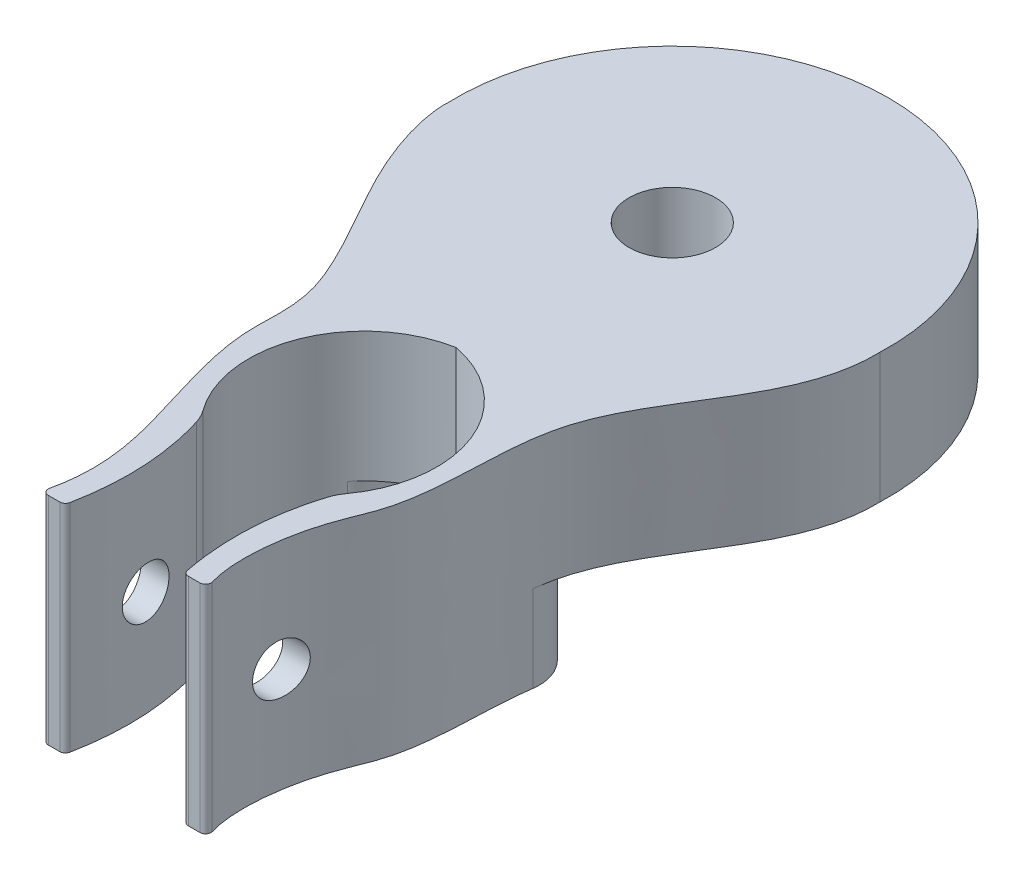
ISO-10303-21;
HEADER;
FILE_DESCRIPTION(('STEP AP214'),'2;1');
FILE_NAME('part.step','',(''),(''),'','','');
FILE_SCHEMA(('AUTOMOTIVE_DESIGN { 1 0 10303 214 1 1 1 1 }'));
ENDSEC;
DATA;
#1=APPLICATION_CONTEXT('core data for automotive mechanical design processes');
#2=APPLICATION_PROTOCOL_DEFINITION('international standard','automotive_design',2000,#1);
#3=PRODUCT_CONTEXT('',#1,'mechanical');
#4=PRODUCT('Part','Part','',(#3));
#5=PRODUCT_RELATED_PRODUCT_CATEGORY('part','',(#4));
#6=PRODUCT_DEFINITION_FORMATION('','',#4);
#7=PRODUCT_DEFINITION_CONTEXT('part definition',#1,'design');
#8=PRODUCT_DEFINITION('design','',#6,#7);
#9=PRODUCT_DEFINITION_SHAPE('','',#8);
#10=(LENGTH_UNIT() NAMED_UNIT(*) SI_UNIT(.MILLI.,.METRE.));
#11=(NAMED_UNIT(*) PLANE_ANGLE_UNIT() SI_UNIT($,.RADIAN.));
#12=(NAMED_UNIT(*) SI_UNIT($,.STERADIAN.) SOLID_ANGLE_UNIT());
#13=UNCERTAINTY_MEASURE_WITH_UNIT(LENGTH_MEASURE(1.E-05),#10,'distance_accuracy_value','');
#14=(GEOMETRIC_REPRESENTATION_CONTEXT(3) GLOBAL_UNCERTAINTY_ASSIGNED_CONTEXT((#13)) GLOBAL_UNIT_ASSIGNED_CONTEXT((#10,
#11,#12)) REPRESENTATION_CONTEXT('',''));
#15=CARTESIAN_POINT('',(0.,0.,0.));
#16=DIRECTION('',(0.,0.,1.));
#17=DIRECTION('',(1.,0.,0.));
#18=AXIS2_PLACEMENT_3D('',#15,#16,#17);
#19=CARTESIAN_POINT('',(-6.93411925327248,0.,15.7482204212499));
#20=DIRECTION('',(0.,-1.,0.));
#21=DIRECTION('',(0.,0.,-1.));
#22=AXIS2_PLACEMENT_3D('',#19,#20,#21);
#23=PLANE('',#22);
#24=CARTESIAN_POINT('',(-1.25597785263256,0.,19.3588384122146));
#25=DIRECTION('',(0.,-1.,0.));
#26=DIRECTION('',(0.,0.,-1.));
#27=AXIS2_PLACEMENT_3D('',#24,#25,#26);
#28=CIRCLE('',#27,6.77625334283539);
#29=CARTESIAN_POINT('',(3.97241342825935,0.,15.0482080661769));
#30=VERTEX_POINT('',#29);
#31=CARTESIAN_POINT('',(4.21241176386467,0.,23.3606285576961));
#32=VERTEX_POINT('',#31);
#33=EDGE_CURVE('E299',#30,#32,#28,.T.);
#34=ORIENTED_EDGE('',*,*,#33,.F.);
#35=CARTESIAN_POINT('',(5.93221528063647,0.,13.4324182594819));
#36=DIRECTION('',(0.,-1.,0.));
#37=DIRECTION('',(0.,0.,-1.));
#38=AXIS2_PLACEMENT_3D('',#35,#36,#37);
#39=CIRCLE('',#38,2.54);
#40=CARTESIAN_POINT('',(3.66205072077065,0.,12.293140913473));
#41=VERTEX_POINT('',#40);
#42=EDGE_CURVE('E59',#30,#41,#39,.T.);
#43=ORIENTED_EDGE('',*,*,#42,.T.);
#44=CARTESIAN_POINT('',(4.38720927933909,0.,14.7274262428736));
#45=DIRECTION('',(0.,-1.,0.));
#46=DIRECTION('',(0.,0.,-1.));
#47=AXIS2_PLACEMENT_3D('',#44,#45,#46);
#48=CIRCLE('',#47,2.54);
#49=CARTESIAN_POINT('',(6.90221502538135,0.,15.0828782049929));
#50=VERTEX_POINT('',#49);
#51=EDGE_CURVE('E254',#41,#50,#48,.T.);
#52=ORIENTED_EDGE('',*,*,#51,.T.);
#53=CARTESIAN_POINT('',(4.77346849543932,0.,31.7962230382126));
#54=CARTESIAN_POINT('',(4.26261652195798,0.,30.1479997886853));
#55=CARTESIAN_POINT('',(4.52523901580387,0.,26.6602313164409));
#56=CARTESIAN_POINT('',(7.08560364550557,0.,20.9954102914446));
#57=CARTESIAN_POINT('',(5.48854782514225,0.,11.2875043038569));
#58=CARTESIAN_POINT('',(12.8342449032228,0.,5.63803468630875));
#59=CARTESIAN_POINT('',(12.6900757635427,0.,0.501973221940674));
#60=B_SPLINE_CURVE_WITH_KNOTS('',3,(#53,#54,#55,#56,#57,#58,#59),.UNSPECIFIED.,.F.,.F.,(4,1,1,1,
4),(0.,0.239032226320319,0.296991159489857,0.579589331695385,1.),.UNSPECIFIED.);
#61=CARTESIAN_POINT('',(4.77346849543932,0.,31.7962230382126));
#62=VERTEX_POINT('',#61);
#63=EDGE_CURVE('E321',#62,#50,#60,.T.);
#64=ORIENTED_EDGE('',*,*,#63,.F.);
#65=CARTESIAN_POINT('',(4.45105676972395,0.,31.8682610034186));
#66=DIRECTION('',(0.,1.,0.));
#67=DIRECTION('',(0.,0.,-1.));
#68=AXIS2_PLACEMENT_3D('',#65,#66,#67);
#69=CIRCLE('',#68,0.330361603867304);
#70=CARTESIAN_POINT('',(4.45105676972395,0.,32.1986226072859));
#71=VERTEX_POINT('',#70);
#72=EDGE_CURVE('E320',#71,#62,#69,.T.);
#73=ORIENTED_EDGE('',*,*,#72,.F.);
#74=DIRECTION('',(1.,0.,0.));
#75=VECTOR('',#74,1.);
#76=CARTESIAN_POINT('',(4.45105676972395,0.,32.1986226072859));
#77=LINE('',#76,#75);
#78=CARTESIAN_POINT('',(3.77597646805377,0.,32.1986226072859));
#79=VERTEX_POINT('',#78);
#80=EDGE_CURVE('E318',#79,#71,#77,.T.);
#81=ORIENTED_EDGE('',*,*,#80,.F.);
#82=CARTESIAN_POINT('',(3.77597646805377,0.,31.8682610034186));
#83=DIRECTION('',(0.,1.,0.));
#84=DIRECTION('',(0.,0.,1.));
#85=AXIS2_PLACEMENT_3D('',#82,#83,#84);
#86=CIRCLE('',#85,0.330361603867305);
#87=CARTESIAN_POINT('',(3.45189480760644,0.,31.932369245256));
#88=VERTEX_POINT('',#87);
#89=EDGE_CURVE('E313',#88,#79,#86,.T.);
#90=ORIENTED_EDGE('',*,*,#89,.F.);
#91=CARTESIAN_POINT('',(3.83488723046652,0.,24.1124032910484));
#92=CARTESIAN_POINT('',(3.66684486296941,0.,24.6575247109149));
#93=CARTESIAN_POINT('',(3.02859140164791,0.,27.2020407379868));
#94=CARTESIAN_POINT('',(3.03837590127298,0.,29.8419376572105));
#95=CARTESIAN_POINT('',(3.45189480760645,0.,31.932369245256));
#96=B_SPLINE_CURVE_WITH_KNOTS('',3,(#91,#92,#93,#94,#95),.UNSPECIFIED.,.F.,.F.,(4,1,4),
(0.0550755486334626,0.252507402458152,0.969570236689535),.UNSPECIFIED.);
#97=CARTESIAN_POINT('',(3.83488723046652,0.,24.1124032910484));
#98=VERTEX_POINT('',#97);
#99=EDGE_CURVE('E309',#98,#88,#96,.T.);
#100=ORIENTED_EDGE('',*,*,#99,.F.);
#101=CARTESIAN_POINT('',(6.26217420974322,0.,24.8606531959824));
#102=DIRECTION('',(0.,1.,0.));
#103=DIRECTION('',(0.,0.,1.));
#104=AXIS2_PLACEMENT_3D('',#101,#102,#103);
#105=CIRCLE('',#104,2.54);
#106=EDGE_CURVE('E302',#32,#98,#105,.T.);
#107=ORIENTED_EDGE('',*,*,#106,.F.);
#108=EDGE_LOOP('',(#34,#43,#52,#64,#73,#81,#90,#100,#107));
#109=FACE_BOUND('',#108,.T.);
#110=ADVANCED_FACE('F32',(#109),#23,.T.);
#111=CARTESIAN_POINT('',(-6.93411925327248,12.7,15.7482204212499));
#112=DIRECTION('',(0.,-1.,0.));
#113=DIRECTION('',(0.,0.,-1.));
#114=AXIS2_PLACEMENT_3D('',#111,#112,#113);
#115=PLANE('',#114);
#116=CARTESIAN_POINT('',(-12.6900757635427,12.7,0.50197322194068));
#117=CARTESIAN_POINT('',(-12.7085946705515,12.7,0.534595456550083));
#118=CARTESIAN_POINT('',(-12.9445111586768,12.7,3.81873144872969));
#119=CARTESIAN_POINT('',(-6.44251711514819,12.7,13.8864500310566));
#120=CARTESIAN_POINT('',(-7.36026092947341,12.7,18.4591788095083));
#121=CARTESIAN_POINT('',(-5.27387900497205,12.7,24.7590934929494));
#122=CARTESIAN_POINT('',(-4.15604476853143,12.7,29.0328933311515));
#123=CARTESIAN_POINT('',(-4.77346849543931,12.7,31.7962230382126));
#124=B_SPLINE_CURVE_WITH_KNOTS('',3,(#116,#117,#118,#119,#120,#121,#122,#123),.UNSPECIFIED.,.F.,
.F.,(4,1,1,1,1,4),(0.,0.279659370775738,0.433863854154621,0.566787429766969,0.759908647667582,
0.988953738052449),.UNSPECIFIED.);
#125=CARTESIAN_POINT('',(-12.6900757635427,12.7,0.501973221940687));
#126=VERTEX_POINT('',#125);
#127=CARTESIAN_POINT('',(-4.77346849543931,12.7,31.7962230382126));
#128=VERTEX_POINT('',#127);
#129=EDGE_CURVE('E324',#126,#128,#124,.T.);
#130=ORIENTED_EDGE('',*,*,#129,.T.);
#131=CARTESIAN_POINT('',(-4.45105676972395,12.7,31.8682610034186));
#132=DIRECTION('',(0.,1.,0.));
#133=DIRECTION('',(0.,0.,1.));
#134=AXIS2_PLACEMENT_3D('',#131,#132,#133);
#135=CIRCLE('',#134,0.330361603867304);
#136=CARTESIAN_POINT('',(-4.45105676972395,12.7,32.1986226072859));
#137=VERTEX_POINT('',#136);
#138=EDGE_CURVE('E330',#128,#137,#135,.T.);
#139=ORIENTED_EDGE('',*,*,#138,.T.);
#140=DIRECTION('',(1.,0.,0.));
#141=VECTOR('',#140,1.);
#142=CARTESIAN_POINT('',(-4.45105676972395,12.7,32.1986226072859));
#143=LINE('',#142,#141);
#144=CARTESIAN_POINT('',(-3.77597646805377,12.7,32.1986226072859));
#145=VERTEX_POINT('',#144);
#146=EDGE_CURVE('E335',#137,#145,#143,.T.);
#147=ORIENTED_EDGE('',*,*,#146,.T.);
#148=CARTESIAN_POINT('',(-3.77597646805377,12.7,31.8682610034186));
#149=DIRECTION('',(0.,1.,0.));
#150=DIRECTION('',(0.,0.,-1.));
#151=AXIS2_PLACEMENT_3D('',#148,#149,#150);
#152=CIRCLE('',#151,0.330361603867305);
#153=CARTESIAN_POINT('',(-3.45189480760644,12.7,31.932369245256));
#154=VERTEX_POINT('',#153);
#155=EDGE_CURVE('E617',#145,#154,#152,.T.);
#156=ORIENTED_EDGE('',*,*,#155,.T.);
#157=CARTESIAN_POINT('',(-3.45189480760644,12.7,31.932369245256));
#158=CARTESIAN_POINT('',(-3.03837590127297,12.7,29.8419376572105));
#159=CARTESIAN_POINT('',(-3.0285914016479,12.7,27.2020407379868));
#160=CARTESIAN_POINT('',(-3.6668448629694,12.7,24.6575247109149));
#161=CARTESIAN_POINT('',(-3.83488723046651,12.7,24.1124032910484));
#162=B_SPLINE_CURVE_WITH_KNOTS('',3,(#157,#158,#159,#160,#161),.UNSPECIFIED.,.F.,.F.,(4,1,4),
(0.0550755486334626,0.772138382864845,0.969570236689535),.UNSPECIFIED.);
#163=CARTESIAN_POINT('',(-3.83488723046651,12.7,24.1124032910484));
#164=VERTEX_POINT('',#163);
#165=EDGE_CURVE('E613',#154,#164,#162,.T.);
#166=ORIENTED_EDGE('',*,*,#165,.T.);
#167=CARTESIAN_POINT('',(-6.26217420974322,12.7,24.8606531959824));
#168=DIRECTION('',(0.,1.,0.));
#169=DIRECTION('',(0.,0.,-1.));
#170=AXIS2_PLACEMENT_3D('',#167,#168,#169);
#171=CIRCLE('',#170,2.54);
#172=CARTESIAN_POINT('',(-4.21241176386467,12.7,23.3606285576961));
#173=VERTEX_POINT('',#172);
#174=EDGE_CURVE('E611',#164,#173,#171,.T.);
#175=ORIENTED_EDGE('',*,*,#174,.T.);
#176=CARTESIAN_POINT('',(1.25597785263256,12.7,19.3588384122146));
#177=DIRECTION('',(0.,-1.,0.));
#178=DIRECTION('',(0.,0.,1.));
#179=AXIS2_PLACEMENT_3D('',#176,#177,#178);
#180=CIRCLE('',#179,6.77625334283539);
#181=CARTESIAN_POINT('',(0.,12.7,12.7));
#182=VERTEX_POINT('',#181);
#183=EDGE_CURVE('E612',#173,#182,#180,.T.);
#184=ORIENTED_EDGE('',*,*,#183,.T.);
#185=CARTESIAN_POINT('',(-1.25597785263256,12.7,19.3588384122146));
#186=DIRECTION('',(0.,-1.,0.));
#187=DIRECTION('',(0.,0.,-1.));
#188=AXIS2_PLACEMENT_3D('',#185,#186,#187);
#189=CIRCLE('',#188,6.77625334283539);
#190=CARTESIAN_POINT('',(4.21241176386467,12.7,23.3606285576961));
#191=VERTEX_POINT('',#190);
#192=EDGE_CURVE('E615',#182,#191,#189,.T.);
#193=ORIENTED_EDGE('',*,*,#192,.T.);
#194=CARTESIAN_POINT('',(6.26217420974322,12.7,24.8606531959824));
#195=DIRECTION('',(0.,1.,0.));
#196=DIRECTION('',(0.,0.,1.));
#197=AXIS2_PLACEMENT_3D('',#194,#195,#196);
#198=CIRCLE('',#197,2.54);
#199=CARTESIAN_POINT('',(3.83488723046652,12.7,24.1124032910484));
#200=VERTEX_POINT('',#199);
#201=EDGE_CURVE('E567',#191,#200,#198,.T.);
#202=ORIENTED_EDGE('',*,*,#201,.T.);
#203=CARTESIAN_POINT('',(3.83488723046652,12.7,24.1124032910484));
#204=CARTESIAN_POINT('',(3.66684486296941,12.7,24.6575247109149));
#205=CARTESIAN_POINT('',(3.02859140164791,12.7,27.2020407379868));
#206=CARTESIAN_POINT('',(3.03837590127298,12.7,29.8419376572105));
#207=CARTESIAN_POINT('',(3.45189480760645,12.7,31.932369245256));
#208=B_SPLINE_CURVE_WITH_KNOTS('',3,(#203,#204,#205,#206,#207),.UNSPECIFIED.,.F.,.F.,(4,1,4),
(0.0550755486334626,0.252507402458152,0.969570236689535),.UNSPECIFIED.);
#209=CARTESIAN_POINT('',(3.45189480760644,12.7,31.932369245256));
#210=VERTEX_POINT('',#209);
#211=EDGE_CURVE('E560',#200,#210,#208,.T.);
#212=ORIENTED_EDGE('',*,*,#211,.T.);
#213=CARTESIAN_POINT('',(3.77597646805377,12.7,31.8682610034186));
#214=DIRECTION('',(0.,1.,0.));
#215=DIRECTION('',(0.,0.,1.));
#216=AXIS2_PLACEMENT_3D('',#213,#214,#215);
#217=CIRCLE('',#216,0.330361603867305);
#218=CARTESIAN_POINT('',(3.77597646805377,12.7,32.1986226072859));
#219=VERTEX_POINT('',#218);
#220=EDGE_CURVE('E566',#210,#219,#217,.T.);
#221=ORIENTED_EDGE('',*,*,#220,.T.);
#222=DIRECTION('',(1.,0.,0.));
#223=VECTOR('',#222,1.);
#224=CARTESIAN_POINT('',(4.45105676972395,12.7,32.1986226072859));
#225=LINE('',#224,#223);
#226=CARTESIAN_POINT('',(4.45105676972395,12.7,32.1986226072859));
#227=VERTEX_POINT('',#226);
#228=EDGE_CURVE('E573',#219,#227,#225,.T.);
#229=ORIENTED_EDGE('',*,*,#228,.T.);
#230=CARTESIAN_POINT('',(4.45105676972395,12.7,31.8682610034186));
#231=DIRECTION('',(0.,1.,0.));
#232=DIRECTION('',(0.,0.,-1.));
#233=AXIS2_PLACEMENT_3D('',#230,#231,#232);
#234=CIRCLE('',#233,0.330361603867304);
#235=CARTESIAN_POINT('',(4.77346849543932,12.7,31.7962230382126));
#236=VERTEX_POINT('',#235);
#237=EDGE_CURVE('E575',#227,#236,#234,.T.);
#238=ORIENTED_EDGE('',*,*,#237,.T.);
#239=CARTESIAN_POINT('',(4.77346849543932,12.7,31.7962230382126));
#240=CARTESIAN_POINT('',(4.26261652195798,12.7,30.1479997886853));
#241=CARTESIAN_POINT('',(4.52523901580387,12.7,26.6602313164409));
#242=CARTESIAN_POINT('',(7.08560364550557,12.7,20.9954102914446));
#243=CARTESIAN_POINT('',(5.48854782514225,12.7,11.2875043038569));
#244=CARTESIAN_POINT('',(12.8342449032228,12.7,5.63803468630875));
#245=CARTESIAN_POINT('',(12.6900757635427,12.7,0.501973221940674));
#246=B_SPLINE_CURVE_WITH_KNOTS('',3,(#239,#240,#241,#242,#243,#244,#245),.UNSPECIFIED.,.F.,.F.,
(4,1,1,1,4),(0.,0.239032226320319,0.296991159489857,0.579589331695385,1.),.UNSPECIFIED.);
#247=CARTESIAN_POINT('',(12.6900757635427,12.7,0.501973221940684));
#248=VERTEX_POINT('',#247);
#249=EDGE_CURVE('E577',#236,#248,#246,.T.);
#250=ORIENTED_EDGE('',*,*,#249,.T.);
#251=CARTESIAN_POINT('',(0.,12.7,0.));
#252=DIRECTION('',(0.,1.,0.));
#253=DIRECTION('',(0.,0.,-1.));
#254=AXIS2_PLACEMENT_3D('',#251,#252,#253);
#255=CIRCLE('',#254,12.7);
#256=EDGE_CURVE('E204',#248,#126,#255,.T.);
#257=ORIENTED_EDGE('',*,*,#256,.T.);
#258=EDGE_LOOP('',(#130,#139,#147,#156,#166,#175,#184,#193,#202,#212,#221,#229,#238,#250,#257));
#259=FACE_BOUND('',#258,.T.);
#260=CARTESIAN_POINT('',(0.,12.7,0.));
#261=DIRECTION('',(0.,1.,0.));
#262=DIRECTION('',(0.,0.,1.));
#263=AXIS2_PLACEMENT_3D('',#260,#261,#262);
#264=CIRCLE('',#263,2.54);
#265=CARTESIAN_POINT('',(0.,12.7,2.54));
#266=VERTEX_POINT('',#265);
#267=EDGE_CURVE('E341',#266,#266,#264,.T.);
#268=ORIENTED_EDGE('',*,*,#267,.F.);
#269=EDGE_LOOP('',(#268));
#270=FACE_BOUND('',#269,.T.);
#271=ADVANCED_FACE('F366',(#259,#270),#115,.F.);
#272=CARTESIAN_POINT('',(-4.47025085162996,0.,14.7024333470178));
#273=DIRECTION('',(0.,-1.,0.));
#274=DIRECTION('',(0.,0.,-1.));
#275=AXIS2_PLACEMENT_3D('',#272,#273,#274);
#276=CIRCLE('',#275,2.54);
#277=CARTESIAN_POINT('',(-6.99147324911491,0.,15.0107150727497));
#278=VERTEX_POINT('',#277);
#279=CARTESIAN_POINT('',(-3.73136641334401,0.,12.2722790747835));
#280=VERTEX_POINT('',#279);
#281=EDGE_CURVE('E261',#278,#280,#276,.T.);
#282=ORIENTED_EDGE('',*,*,#281,.T.);
#283=CARTESIAN_POINT('',(-5.96798757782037,0.,13.4760754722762));
#284=DIRECTION('',(0.,-1.,0.));
#285=DIRECTION('',(0.,0.,-1.));
#286=AXIS2_PLACEMENT_3D('',#283,#284,#285);
#287=CIRCLE('',#286,2.54);
#288=CARTESIAN_POINT('',(-3.99843270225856,0.,15.0799624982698));
#289=VERTEX_POINT('',#288);
#290=EDGE_CURVE('E271',#280,#289,#287,.T.);
#291=ORIENTED_EDGE('',*,*,#290,.T.);
#292=CARTESIAN_POINT('',(1.25597785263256,0.,19.3588384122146));
#293=DIRECTION('',(0.,-1.,0.));
#294=DIRECTION('',(0.,0.,1.));
#295=AXIS2_PLACEMENT_3D('',#292,#293,#294);
#296=CIRCLE('',#295,6.77625334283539);
#297=CARTESIAN_POINT('',(-4.21241176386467,0.,23.3606285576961));
#298=VERTEX_POINT('',#297);
#299=EDGE_CURVE('E293',#298,#289,#296,.T.);
#300=ORIENTED_EDGE('',*,*,#299,.F.);
#301=CARTESIAN_POINT('',(-6.26217420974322,0.,24.8606531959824));
#302=DIRECTION('',(0.,1.,0.));
#303=DIRECTION('',(0.,0.,-1.));
#304=AXIS2_PLACEMENT_3D('',#301,#302,#303);
#305=CIRCLE('',#304,2.54);
#306=CARTESIAN_POINT('',(-3.83488723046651,0.,24.1124032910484));
#307=VERTEX_POINT('',#306);
#308=EDGE_CURVE('E300',#307,#298,#305,.T.);
#309=ORIENTED_EDGE('',*,*,#308,.F.);
#310=CARTESIAN_POINT('',(-3.45189480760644,0.,31.932369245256));
#311=CARTESIAN_POINT('',(-3.03837590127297,0.,29.8419376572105));
#312=CARTESIAN_POINT('',(-3.0285914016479,0.,27.2020407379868));
#313=CARTESIAN_POINT('',(-3.6668448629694,0.,24.6575247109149));
#314=CARTESIAN_POINT('',(-3.83488723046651,0.,24.1124032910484));
#315=B_SPLINE_CURVE_WITH_KNOTS('',3,(#310,#311,#312,#313,#314),.UNSPECIFIED.,.F.,.F.,(4,1,4),
(0.0550755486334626,0.772138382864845,0.969570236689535),.UNSPECIFIED.);
#316=CARTESIAN_POINT('',(-3.45189480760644,0.,31.932369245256));
#317=VERTEX_POINT('',#316);
#318=EDGE_CURVE('E304',#317,#307,#315,.T.);
#319=ORIENTED_EDGE('',*,*,#318,.F.);
#320=CARTESIAN_POINT('',(-3.77597646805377,0.,31.8682610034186));
#321=DIRECTION('',(0.,1.,0.));
#322=DIRECTION('',(0.,0.,-1.));
#323=AXIS2_PLACEMENT_3D('',#320,#321,#322);
#324=CIRCLE('',#323,0.330361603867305);
#325=CARTESIAN_POINT('',(-3.77597646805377,0.,32.1986226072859));
#326=VERTEX_POINT('',#325);
#327=EDGE_CURVE('E598',#326,#317,#324,.T.);
#328=ORIENTED_EDGE('',*,*,#327,.F.);
#329=DIRECTION('',(1.,0.,0.));
#330=VECTOR('',#329,1.);
#331=CARTESIAN_POINT('',(-4.45105676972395,0.,32.1986226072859));
#332=LINE('',#331,#330);
#333=CARTESIAN_POINT('',(-4.45105676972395,0.,32.1986226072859));
#334=VERTEX_POINT('',#333);
#335=EDGE_CURVE('E596',#334,#326,#332,.T.);
#336=ORIENTED_EDGE('',*,*,#335,.F.);
#337=CARTESIAN_POINT('',(-4.45105676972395,0.,31.8682610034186));
#338=DIRECTION('',(0.,1.,0.));
#339=DIRECTION('',(0.,0.,1.));
#340=AXIS2_PLACEMENT_3D('',#337,#338,#339);
#341=CIRCLE('',#340,0.330361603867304);
#342=CARTESIAN_POINT('',(-4.77346849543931,0.,31.7962230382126));
#343=VERTEX_POINT('',#342);
#344=EDGE_CURVE('E591',#343,#334,#341,.T.);
#345=ORIENTED_EDGE('',*,*,#344,.F.);
#346=CARTESIAN_POINT('',(-12.6900757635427,0.,0.50197322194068));
#347=CARTESIAN_POINT('',(-12.7085946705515,0.,0.534595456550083));
#348=CARTESIAN_POINT('',(-12.9445111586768,0.,3.81873144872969));
#349=CARTESIAN_POINT('',(-6.44251711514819,0.,13.8864500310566));
#350=CARTESIAN_POINT('',(-7.36026092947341,0.,18.4591788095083));
#351=CARTESIAN_POINT('',(-5.27387900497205,0.,24.7590934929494));
#352=CARTESIAN_POINT('',(-4.15604476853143,0.,29.0328933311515));
#353=CARTESIAN_POINT('',(-4.77346849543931,0.,31.7962230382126));
#354=B_SPLINE_CURVE_WITH_KNOTS('',3,(#346,#347,#348,#349,#350,#351,#352,#353),.UNSPECIFIED.,.F.,
.F.,(4,1,1,1,1,4),(0.,0.279659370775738,0.433863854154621,0.566787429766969,0.759908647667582,
0.988953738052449),.UNSPECIFIED.);
#355=EDGE_CURVE('E587',#278,#343,#354,.T.);
#356=ORIENTED_EDGE('',*,*,#355,.F.);
#357=EDGE_LOOP('',(#282,#291,#300,#309,#319,#328,#336,#345,#356));
#358=FACE_BOUND('',#357,.T.);
#359=ADVANCED_FACE('F291',(#358),#23,.T.);
#360=DIRECTION('',(0.,-1.,0.));
#361=VECTOR('',#360,1.);
#362=SURFACE_OF_LINEAR_EXTRUSION('',#124,#361);
#363=CARTESIAN_POINT('',(-4.95633280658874,6.16582696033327,26.2198274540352));
#364=CARTESIAN_POINT('',(-4.95633093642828,6.24700173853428,26.2198332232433));
#365=CARTESIAN_POINT('',(-4.95468988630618,6.32825554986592,26.2265713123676));
#366=CARTESIAN_POINT('',(-4.94984501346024,6.44829752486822,26.2465882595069));
#367=CARTESIAN_POINT('',(-4.94783030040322,6.48803576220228,26.2549227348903));
#368=CARTESIAN_POINT('',(-4.94303519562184,6.56668331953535,26.2748321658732));
#369=CARTESIAN_POINT('',(-4.94025417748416,6.60559193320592,26.2864097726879));
#370=CARTESIAN_POINT('',(-4.93082928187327,6.72045100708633,26.3258242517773));
#371=CARTESIAN_POINT('',(-4.92309473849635,6.79474723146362,26.3583785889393));
#372=CARTESIAN_POINT('',(-4.90513999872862,6.93677734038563,26.4350646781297));
#373=CARTESIAN_POINT('',(-4.89491932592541,7.00450996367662,26.4791986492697));
#374=CARTESIAN_POINT('',(-4.8780643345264,7.10031269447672,26.5534114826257));
#375=CARTESIAN_POINT('',(-4.87214051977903,7.13149723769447,26.5797179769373));
#376=CARTESIAN_POINT('',(-4.85988117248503,7.19150813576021,26.6347494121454));
#377=CARTESIAN_POINT('',(-4.85354604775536,7.22033676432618,26.6634719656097));
#378=CARTESIAN_POINT('',(-4.83403048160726,7.3030778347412,26.7530398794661));
#379=CARTESIAN_POINT('',(-4.82033748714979,7.35325866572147,26.8172957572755));
#380=CARTESIAN_POINT('',(-4.79194668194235,7.44340495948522,26.954756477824));
#381=CARTESIAN_POINT('',(-4.77723230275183,7.48308343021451,27.0281449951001));
#382=CARTESIAN_POINT('',(-4.7478441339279,7.54952543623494,27.1805759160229));
#383=CARTESIAN_POINT('',(-4.73317034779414,7.57628789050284,27.2596187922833));
#384=CARTESIAN_POINT('',(-4.70439156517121,7.61634436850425,27.4221089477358));
#385=CARTESIAN_POINT('',(-4.69029466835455,7.62948593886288,27.5055953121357));
#386=CARTESIAN_POINT('',(-4.66344952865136,7.64131172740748,27.6738028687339));
#387=CARTESIAN_POINT('',(-4.6507012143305,7.6399967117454,27.7585239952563));
#388=CARTESIAN_POINT('',(-4.62710919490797,7.62290283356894,27.9259812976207));
#389=CARTESIAN_POINT('',(-4.61624936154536,7.60725441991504,28.0087284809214));
#390=CARTESIAN_POINT('',(-4.59654475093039,7.56201088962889,28.1705694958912));
#391=CARTESIAN_POINT('',(-4.5876997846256,7.53241708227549,28.249663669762));
#392=CARTESIAN_POINT('',(-4.57219484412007,7.46064779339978,28.4005773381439));
#393=CARTESIAN_POINT('',(-4.56550202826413,7.41868223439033,28.4724933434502));
#394=CARTESIAN_POINT('',(-4.55397270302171,7.32316274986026,28.6083335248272));
#395=CARTESIAN_POINT('',(-4.54913611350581,7.26960932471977,28.6722580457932));
#396=CARTESIAN_POINT('',(-4.54107983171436,7.15291119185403,28.7897424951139));
#397=CARTESIAN_POINT('',(-4.53784746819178,7.0898469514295,28.8433815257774));
#398=CARTESIAN_POINT('',(-4.53260550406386,6.9556019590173,28.9393752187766));
#399=CARTESIAN_POINT('',(-4.53059590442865,6.88442120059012,28.9817298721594));
#400=CARTESIAN_POINT('',(-4.52746056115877,6.73592427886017,29.0539565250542));
#401=CARTESIAN_POINT('',(-4.52633526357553,6.65860504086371,29.0838222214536));
#402=CARTESIAN_POINT('',(-4.52469256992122,6.50005194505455,29.1301893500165));
#403=CARTESIAN_POINT('',(-4.52417517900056,6.41881805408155,29.1466906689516));
#404=CARTESIAN_POINT('',(-4.5235805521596,6.25457859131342,29.1658783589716));
#405=CARTESIAN_POINT('',(-4.52350414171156,6.17156998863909,29.1685388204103));
#406=CARTESIAN_POINT('',(-4.52376568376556,6.0062827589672,29.1598991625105));
#407=CARTESIAN_POINT('',(-4.52410363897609,5.92400413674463,29.1485989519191));
#408=CARTESIAN_POINT('',(-4.52531127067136,5.76247392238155,29.1123509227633));
#409=CARTESIAN_POINT('',(-4.52618119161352,5.68322373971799,29.0873968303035));
#410=CARTESIAN_POINT('',(-4.52869534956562,5.53004418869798,29.0245498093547));
#411=CARTESIAN_POINT('',(-4.53033958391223,5.45611480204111,28.9866569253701));
#412=CARTESIAN_POINT('',(-4.5347255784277,5.315737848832,28.8990565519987));
#413=CARTESIAN_POINT('',(-4.53746648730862,5.24928453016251,28.8493582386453));
#414=CARTESIAN_POINT('',(-4.54439265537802,5.12568716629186,28.7395737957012));
#415=CARTESIAN_POINT('',(-4.54857787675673,5.0685428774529,28.6794879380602));
#416=CARTESIAN_POINT('',(-4.55868346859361,4.96528612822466,28.5508211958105));
#417=CARTESIAN_POINT('',(-4.5646002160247,4.91915099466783,28.4822582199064));
#418=CARTESIAN_POINT('',(-4.57836141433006,4.83902980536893,28.3385472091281));
#419=CARTESIAN_POINT('',(-4.58620583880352,4.80504358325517,28.2633992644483));
#420=CARTESIAN_POINT('',(-4.60386021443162,4.75008054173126,28.1086349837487));
#421=CARTESIAN_POINT('',(-4.61367186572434,4.72911503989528,28.0290148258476));
#422=CARTESIAN_POINT('',(-4.63510249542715,4.70071797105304,27.8676361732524));
#423=CARTESIAN_POINT('',(-4.64672157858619,4.69328718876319,27.7858775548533));
#424=CARTESIAN_POINT('',(-4.67156280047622,4.69204470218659,27.6216286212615));
#425=CARTESIAN_POINT('',(-4.6848003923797,4.69837582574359,27.5391395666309));
#426=CARTESIAN_POINT('',(-4.71227529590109,4.72466608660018,27.3765440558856));
#427=CARTESIAN_POINT('',(-4.72651271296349,4.74462666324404,27.2964378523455));
#428=CARTESIAN_POINT('',(-4.75560874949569,4.79804313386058,27.1394370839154));
#429=CARTESIAN_POINT('',(-4.77047368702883,4.83171169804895,27.0626152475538));
#430=CARTESIAN_POINT('',(-4.79250147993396,4.89156529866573,26.9525368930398));
#431=CARTESIAN_POINT('',(-4.79980055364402,4.91308011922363,26.9166966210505));
#432=CARTESIAN_POINT('',(-4.81422874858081,4.95911590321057,26.8469095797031));
#433=CARTESIAN_POINT('',(-4.82135768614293,4.98363995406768,26.8129648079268));
#434=CARTESIAN_POINT('',(-4.84240612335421,5.06173030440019,26.714069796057));
#435=CARTESIAN_POINT('',(-4.85592141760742,5.11963802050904,26.6523839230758));
#436=CARTESIAN_POINT('',(-4.88109901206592,5.24537960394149,26.5396758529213));
#437=CARTESIAN_POINT('',(-4.89276166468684,5.31321157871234,26.4886516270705));
#438=CARTESIAN_POINT('',(-4.908284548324,5.42040035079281,26.4216479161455));
#439=CARTESIAN_POINT('',(-4.91310441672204,5.45677478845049,26.4010094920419));
#440=CARTESIAN_POINT('',(-4.92206046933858,5.53117479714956,26.3628837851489));
#441=CARTESIAN_POINT('',(-4.92619724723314,5.56919889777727,26.3453937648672));
#442=CARTESIAN_POINT('',(-4.93748410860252,5.68533852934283,26.2978861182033));
#443=CARTESIAN_POINT('',(-4.94352972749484,5.76565119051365,26.2727497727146));
#444=CARTESIAN_POINT('',(-4.95069263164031,5.89970092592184,26.2430743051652));
#445=CARTESIAN_POINT('',(-4.95280201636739,5.95251744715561,26.2343717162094));
#446=CARTESIAN_POINT('',(-4.95562270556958,6.05882018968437,26.2227464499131));
#447=CARTESIAN_POINT('',(-4.95633403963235,6.11230639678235,26.2198236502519));
#448=CARTESIAN_POINT('',(-4.95633280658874,6.16582696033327,26.2198274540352));
#449=B_SPLINE_CURVE_WITH_KNOTS('',3,(#363,#364,#365,#366,#367,#368,#369,#370,#371,#372,#373,
#374,#375,#376,#377,#378,#379,#380,#381,#382,#383,#384,#385,#386,#387,#388,#389,#390,#391,#392,
#393,#394,#395,#396,#397,#398,#399,#400,#401,#402,#403,#404,#405,#406,#407,#408,#409,#410,#411,
#412,#413,#414,#415,#416,#417,#418,#419,#420,#421,#422,#423,#424,#425,#426,#427,#428,#429,#430,
#431,#432,#433,#434,#435,#436,#437,#438,#439,#440,#441,#442,#443,#444,#445,#446,#447,#448),
.UNSPECIFIED.,.T.,.F.,(4,2,2,2,2,2,2,2,2,2,2,2,2,2,2,2,2,2,2,2,2,2,2,2,2,2,2,2,2,2,2,2,2,2,2,2,
2,2,2,2,2,2,4),(0.,0.24329340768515,0.365133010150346,0.487072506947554,0.730312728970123,
0.973599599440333,1.09715425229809,1.2205882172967,1.46740609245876,1.7203991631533,
1.97341340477,2.22922992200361,2.48503288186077,2.73853065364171,2.99200463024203,
3.24140354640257,3.49079169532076,3.73817734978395,3.98556320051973,4.23307375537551,
4.48058640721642,4.72856222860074,4.97653967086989,5.22463115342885,5.47272178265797,
5.72062020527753,5.96851213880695,6.21588904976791,6.46326257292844,6.71085081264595,
6.95845340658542,7.20863800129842,7.4588490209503,7.71309952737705,7.84027490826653,
7.96758187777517,8.22330883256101,8.47898708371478,8.60514352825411,8.73118974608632,
8.98282541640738,9.14323824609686,9.30364768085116),.UNSPECIFIED.);
#450=CARTESIAN_POINT('',(-4.95633280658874,6.16582696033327,26.2198274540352));
#451=VERTEX_POINT('',#450);
#452=EDGE_CURVE('E36',#451,#451,#449,.T.);
#453=ORIENTED_EDGE('',*,*,#452,.T.);
#454=EDGE_LOOP('',(#453));
#455=FACE_BOUND('',#454,.T.);
#456=CARTESIAN_POINT('',(-12.6900757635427,5.08,0.50197322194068));
#457=CARTESIAN_POINT('',(-12.7085946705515,5.08,0.534595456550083));
#458=CARTESIAN_POINT('',(-12.9445111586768,5.08,3.81873144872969));
#459=CARTESIAN_POINT('',(-6.44251711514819,5.08,13.8864500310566));
#460=CARTESIAN_POINT('',(-7.36026092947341,5.08,18.4591788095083));
#461=CARTESIAN_POINT('',(-5.27387900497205,5.08,24.7590934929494));
#462=CARTESIAN_POINT('',(-4.15604476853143,5.08,29.0328933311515));
#463=CARTESIAN_POINT('',(-4.77346849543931,5.08,31.7962230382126));
#464=B_SPLINE_CURVE_WITH_KNOTS('',3,(#456,#457,#458,#459,#460,#461,#462,#463),.UNSPECIFIED.,.F.,
.F.,(4,1,1,1,1,4),(0.,0.279659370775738,0.433863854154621,0.566787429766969,0.759908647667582,
0.988953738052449),.UNSPECIFIED.);
#465=CARTESIAN_POINT('',(-12.6900757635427,5.08,0.501973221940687));
#466=VERTEX_POINT('',#465);
#467=CARTESIAN_POINT('',(-6.99147324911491,5.08,15.0107150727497));
#468=VERTEX_POINT('',#467);
#469=EDGE_CURVE('E185',#466,#468,#464,.T.);
#470=ORIENTED_EDGE('',*,*,#469,.T.);
#471=DIRECTION('',(0.,-1.,0.));
#472=VECTOR('',#471,1.);
#473=CARTESIAN_POINT('',(-6.99147324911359,5.08,15.0107150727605));
#474=LINE('',#473,#472);
#475=EDGE_CURVE('E258',#468,#278,#474,.T.);
#476=ORIENTED_EDGE('',*,*,#475,.T.);
#477=ORIENTED_EDGE('',*,*,#355,.T.);
#478=DIRECTION('',(0.,-1.,0.));
#479=VECTOR('',#478,1.);
#480=CARTESIAN_POINT('',(-4.77346849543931,12.7,31.7962230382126));
#481=LINE('',#480,#479);
#482=EDGE_CURVE('E245',#128,#343,#481,.T.);
#483=ORIENTED_EDGE('',*,*,#482,.F.);
#484=ORIENTED_EDGE('',*,*,#129,.F.);
#485=DIRECTION('',(0.,-1.,0.));
#486=VECTOR('',#485,1.);
#487=CARTESIAN_POINT('',(-12.6900757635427,12.7,0.501973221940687));
#488=LINE('',#487,#486);
#489=EDGE_CURVE('E206',#126,#466,#488,.T.);
#490=ORIENTED_EDGE('',*,*,#489,.T.);
#491=EDGE_LOOP('',(#470,#476,#477,#483,#484,#490));
#492=FACE_BOUND('',#491,.T.);
#493=ADVANCED_FACE('F347',(#455,#492),#362,.F.);
#494=CARTESIAN_POINT('',(-4.45105676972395,12.7,31.8682610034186));
#495=DIRECTION('',(0.,-1.,0.));
#496=DIRECTION('',(0.,0.,-1.));
#497=AXIS2_PLACEMENT_3D('',#494,#495,#496);
#498=CYLINDRICAL_SURFACE('',#497,0.330361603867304);
#499=ORIENTED_EDGE('',*,*,#344,.T.);
#500=DIRECTION('',(0.,-1.,0.));
#501=VECTOR('',#500,1.);
#502=CARTESIAN_POINT('',(-4.45105676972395,12.7,32.1986226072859));
#503=LINE('',#502,#501);
#504=EDGE_CURVE('E242',#137,#334,#503,.T.);
#505=ORIENTED_EDGE('',*,*,#504,.F.);
#506=ORIENTED_EDGE('',*,*,#138,.F.);
#507=ORIENTED_EDGE('',*,*,#482,.T.);
#508=EDGE_LOOP('',(#499,#505,#506,#507));
#509=FACE_BOUND('',#508,.T.);
#510=ADVANCED_FACE('F352',(#509),#498,.T.);
#511=CARTESIAN_POINT('',(-4.45105676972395,12.7,32.1986226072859));
#512=DIRECTION('',(0.,0.,-1.));
#513=DIRECTION('',(-1.,0.,0.));
#514=AXIS2_PLACEMENT_3D('',#511,#512,#513);
#515=PLANE('',#514);
#516=ORIENTED_EDGE('',*,*,#335,.T.);
#517=DIRECTION('',(0.,-1.,0.));
#518=VECTOR('',#517,1.);
#519=CARTESIAN_POINT('',(-3.77597646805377,12.7,32.1986226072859));
#520=LINE('',#519,#518);
#521=EDGE_CURVE('E239',#145,#326,#520,.T.);
#522=ORIENTED_EDGE('',*,*,#521,.F.);
#523=ORIENTED_EDGE('',*,*,#146,.F.);
#524=ORIENTED_EDGE('',*,*,#504,.T.);
#525=EDGE_LOOP('',(#516,#522,#523,#524));
#526=FACE_BOUND('',#525,.T.);
#527=ADVANCED_FACE('F393',(#526),#515,.F.);
#528=CARTESIAN_POINT('',(-3.77597646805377,12.7,31.8682610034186));
#529=DIRECTION('',(0.,-1.,0.));
#530=DIRECTION('',(0.,0.,-1.));
#531=AXIS2_PLACEMENT_3D('',#528,#529,#530);
#532=CYLINDRICAL_SURFACE('',#531,0.330361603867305);
#533=ORIENTED_EDGE('',*,*,#327,.T.);
#534=DIRECTION('',(0.,-1.,0.));
#535=VECTOR('',#534,1.);
#536=CARTESIAN_POINT('',(-3.45189480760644,12.7,31.932369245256));
#537=LINE('',#536,#535);
#538=EDGE_CURVE('E236',#154,#317,#537,.T.);
#539=ORIENTED_EDGE('',*,*,#538,.F.);
#540=ORIENTED_EDGE('',*,*,#155,.F.);
#541=ORIENTED_EDGE('',*,*,#521,.T.);
#542=EDGE_LOOP('',(#533,#539,#540,#541));
#543=FACE_BOUND('',#542,.T.);
#544=ADVANCED_FACE('F400',(#543),#532,.T.);
#545=DIRECTION('',(0.,-1.,0.));
#546=VECTOR('',#545,1.);
#547=SURFACE_OF_LINEAR_EXTRUSION('',#162,#546);
#548=CARTESIAN_POINT('',(-3.33934247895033,6.16582696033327,26.2198274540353));
#549=CARTESIAN_POINT('',(-3.33934086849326,6.08373832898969,26.2198331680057));
#550=CARTESIAN_POINT('',(-3.33821005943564,6.00156900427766,26.226722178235));
#551=CARTESIAN_POINT('',(-3.33489129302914,5.88016079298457,26.2472026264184));
#552=CARTESIAN_POINT('',(-3.33351287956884,5.83996798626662,26.2557313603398));
#553=CARTESIAN_POINT('',(-3.33024358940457,5.76041519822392,26.2761133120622));
#554=CARTESIAN_POINT('',(-3.32835227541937,5.72105595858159,26.2879693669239));
#555=CARTESIAN_POINT('',(-3.32196873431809,5.60483588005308,26.3283600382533));
#556=CARTESIAN_POINT('',(-3.31676155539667,5.52964543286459,26.3617490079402));
#557=CARTESIAN_POINT('',(-3.30483871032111,5.3859491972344,26.4405007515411));
#558=CARTESIAN_POINT('',(-3.29812289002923,5.31744409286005,26.4858647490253));
#559=CARTESIAN_POINT('',(-3.287270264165,5.22087860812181,26.562056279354));
#560=CARTESIAN_POINT('',(-3.28350487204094,5.1896002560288,26.588945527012));
#561=CARTESIAN_POINT('',(-3.27579029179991,5.12944594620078,26.6452071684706));
#562=CARTESIAN_POINT('',(-3.27184128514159,5.10056769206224,26.6745771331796));
#563=CARTESIAN_POINT('',(-3.25981332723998,5.01777101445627,26.7661781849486));
#564=CARTESIAN_POINT('',(-3.25155115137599,4.96767081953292,26.8319161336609));
#565=CARTESIAN_POINT('',(-3.23502516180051,4.87874108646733,26.9714682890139));
#566=CARTESIAN_POINT('',(-3.22676208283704,4.8400235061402,27.0453534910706));
#567=CARTESIAN_POINT('',(-3.21081925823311,4.77556656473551,27.1986549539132));
#568=CARTESIAN_POINT('',(-3.203139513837,4.74982723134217,27.2780712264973));
#569=CARTESIAN_POINT('',(-3.18877972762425,4.71210242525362,27.4401846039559));
#570=CARTESIAN_POINT('',(-3.18209958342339,4.70011554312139,27.522881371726));
#571=CARTESIAN_POINT('',(-3.17002334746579,4.6902788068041,27.6892048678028));
#572=CARTESIAN_POINT('',(-3.16462720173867,4.69242835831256,27.7728315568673));
#573=CARTESIAN_POINT('',(-3.15528621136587,4.71078433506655,27.9380390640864));
#574=CARTESIAN_POINT('',(-3.15133186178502,4.72689624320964,28.0196298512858));
#575=CARTESIAN_POINT('',(-3.14480750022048,4.7726199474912,28.1789943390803));
#576=CARTESIAN_POINT('',(-3.14223745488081,4.80223141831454,28.2567681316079));
#577=CARTESIAN_POINT('',(-3.13833932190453,4.87395943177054,28.4059186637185));
#578=CARTESIAN_POINT('',(-3.13700571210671,4.91601925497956,28.4773225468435));
#579=CARTESIAN_POINT('',(-3.13530828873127,5.01150373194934,28.612090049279));
#580=CARTESIAN_POINT('',(-3.13494447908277,5.06492843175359,28.6754536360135));
#581=CARTESIAN_POINT('',(-3.13487197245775,5.18167132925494,28.7923846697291));
#582=CARTESIAN_POINT('',(-3.13516373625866,5.24499645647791,28.8459451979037));
#583=CARTESIAN_POINT('',(-3.13607098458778,5.3797220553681,28.9417017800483));
#584=CARTESIAN_POINT('',(-3.13668647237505,5.45112260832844,28.9838977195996));
#585=CARTESIAN_POINT('',(-3.1379383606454,5.6001306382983,29.055805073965));
#586=CARTESIAN_POINT('',(-3.13857480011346,5.67775012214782,29.085491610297));
#587=CARTESIAN_POINT('',(-3.13963032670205,5.83687180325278,29.1314168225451));
#588=CARTESIAN_POINT('',(-3.14004941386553,5.91837399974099,29.1476555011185));
#589=CARTESIAN_POINT('',(-3.14053278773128,6.08296906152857,29.1662258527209));
#590=CARTESIAN_POINT('',(-3.14059698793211,6.16606230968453,29.1685541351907));
#591=CARTESIAN_POINT('',(-3.14035017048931,6.33145979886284,29.1592282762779));
#592=CARTESIAN_POINT('',(-3.14003915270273,6.41376403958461,29.1475741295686));
#593=CARTESIAN_POINT('',(-3.13914188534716,6.57522581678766,29.1106197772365));
#594=CARTESIAN_POINT('',(-3.13855570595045,6.65438414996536,29.0853230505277));
#595=CARTESIAN_POINT('',(-3.13731499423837,6.80733247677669,29.0218035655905));
#596=CARTESIAN_POINT('',(-3.13666046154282,6.88112244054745,28.9835807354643));
#597=CARTESIAN_POINT('',(-3.13556998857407,7.02126691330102,28.8952764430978));
#598=CARTESIAN_POINT('',(-3.13513412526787,7.08761879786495,28.8451908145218));
#599=CARTESIAN_POINT('',(-3.13481150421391,7.21097254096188,28.7345892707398));
#600=CARTESIAN_POINT('',(-3.13492474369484,7.26797444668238,28.6740734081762));
#601=CARTESIAN_POINT('',(-3.1360282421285,7.37096806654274,28.5443821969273));
#602=CARTESIAN_POINT('',(-3.1370178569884,7.41696783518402,28.4752132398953));
#603=CARTESIAN_POINT('',(-3.14015240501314,7.49670273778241,28.3301594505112));
#604=CARTESIAN_POINT('',(-3.14229731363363,7.53043813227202,28.2542747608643));
#605=CARTESIAN_POINT('',(-3.14792398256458,7.5846368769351,28.0981341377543));
#606=CARTESIAN_POINT('',(-3.15140288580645,7.60512834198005,28.0178878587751));
#607=CARTESIAN_POINT('',(-3.15975948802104,7.63239895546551,27.8551710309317));
#608=CARTESIAN_POINT('',(-3.16463718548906,7.6391781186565,27.7727004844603));
#609=CARTESIAN_POINT('',(-3.17571244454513,7.6388706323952,27.6078350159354));
#610=CARTESIAN_POINT('',(-3.18191061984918,7.63177752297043,27.5254401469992));
#611=CARTESIAN_POINT('',(-3.19539584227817,7.60396631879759,27.3630861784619));
#612=CARTESIAN_POINT('',(-3.20268293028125,7.58324771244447,27.2831271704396));
#613=CARTESIAN_POINT('',(-3.21803565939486,7.52861295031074,27.1273645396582));
#614=CARTESIAN_POINT('',(-3.22610554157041,7.49462149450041,27.0515874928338));
#615=CARTESIAN_POINT('',(-3.23839852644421,7.43454320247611,26.9430989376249));
#616=CARTESIAN_POINT('',(-3.24252839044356,7.41299671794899,26.9077923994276));
#617=CARTESIAN_POINT('',(-3.2507915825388,7.3669929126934,26.8390781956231));
#618=CARTESIAN_POINT('',(-3.25492491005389,7.34253275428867,26.8056724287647));
#619=CARTESIAN_POINT('',(-3.26726433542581,7.26477932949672,26.7083811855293));
#620=CARTESIAN_POINT('',(-3.27537121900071,7.20729865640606,26.6477564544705));
#621=CARTESIAN_POINT('',(-3.29073148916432,7.08286080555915,26.5370422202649));
#622=CARTESIAN_POINT('',(-3.2979849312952,7.01590424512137,26.4869520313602));
#623=CARTESIAN_POINT('',(-3.30780939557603,6.90989490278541,26.4208569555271));
#624=CARTESIAN_POINT('',(-3.31090748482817,6.87364125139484,26.4003368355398));
#625=CARTESIAN_POINT('',(-3.31669493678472,6.79953934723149,26.3624416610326));
#626=CARTESIAN_POINT('',(-3.31938465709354,6.76169252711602,26.3450638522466));
#627=CARTESIAN_POINT('',(-3.32675631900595,6.64615805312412,26.2978579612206));
#628=CARTESIAN_POINT('',(-3.33075209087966,6.56635657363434,26.2728828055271));
#629=CARTESIAN_POINT('',(-3.3355347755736,6.43270723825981,26.2432064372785));
#630=CARTESIAN_POINT('',(-3.3369576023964,6.37973092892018,26.2344531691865));
#631=CARTESIAN_POINT('',(-3.33886197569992,6.27312355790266,26.2227618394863));
#632=CARTESIAN_POINT('',(-3.3393435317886,6.21949250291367,26.2198237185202));
#633=CARTESIAN_POINT('',(-3.33934247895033,6.16582696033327,26.2198274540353));
#634=B_SPLINE_CURVE_WITH_KNOTS('',3,(#548,#549,#550,#551,#552,#553,#554,#555,#556,#557,#558,
#559,#560,#561,#562,#563,#564,#565,#566,#567,#568,#569,#570,#571,#572,#573,#574,#575,#576,#577,
#578,#579,#580,#581,#582,#583,#584,#585,#586,#587,#588,#589,#590,#591,#592,#593,#594,#595,#596,
#597,#598,#599,#600,#601,#602,#603,#604,#605,#606,#607,#608,#609,#610,#611,#612,#613,#614,#615,
#616,#617,#618,#619,#620,#621,#622,#623,#624,#625,#626,#627,#628,#629,#630,#631,#632,#633),
.UNSPECIFIED.,.T.,.F.,(4,2,2,2,2,2,2,2,2,2,2,2,2,2,2,2,2,2,2,2,2,2,2,2,2,2,2,2,2,2,2,2,2,2,2,2,
2,2,2,2,2,2,4),(0.,0.246035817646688,0.369248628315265,0.492566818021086,0.738640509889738,
0.984739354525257,1.10886933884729,1.23287915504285,1.48082348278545,1.73113068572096,
1.98143842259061,2.23172050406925,2.48199206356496,2.73058254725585,2.97916704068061,
3.22663588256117,3.47410572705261,3.72174956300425,3.9693958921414,4.21753243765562,
4.4656689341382,4.71386590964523,4.96206297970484,5.21019678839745,5.45833197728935,
5.70655444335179,5.95477565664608,6.20281459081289,6.45084825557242,6.69835363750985,
6.94585875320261,7.19347915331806,7.44110885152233,7.69016431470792,7.81474172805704,
7.93944147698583,8.18998013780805,8.44050248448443,8.56568748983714,8.69076223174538,
8.94049225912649,9.10134011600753,9.26218633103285),.UNSPECIFIED.);
#635=CARTESIAN_POINT('',(-3.33934247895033,6.16582696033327,26.2198274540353));
#636=VERTEX_POINT('',#635);
#637=EDGE_CURVE('E250',#636,#636,#634,.T.);
#638=ORIENTED_EDGE('',*,*,#637,.T.);
#639=EDGE_LOOP('',(#638));
#640=FACE_BOUND('',#639,.T.);
#641=ORIENTED_EDGE('',*,*,#318,.T.);
#642=DIRECTION('',(0.,-1.,0.));
#643=VECTOR('',#642,1.);
#644=CARTESIAN_POINT('',(-3.83488723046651,12.7,24.1124032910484));
#645=LINE('',#644,#643);
#646=EDGE_CURVE('E233',#164,#307,#645,.T.);
#647=ORIENTED_EDGE('',*,*,#646,.F.);
#648=ORIENTED_EDGE('',*,*,#165,.F.);
#649=ORIENTED_EDGE('',*,*,#538,.T.);
#650=EDGE_LOOP('',(#641,#647,#648,#649));
#651=FACE_BOUND('',#650,.T.);
#652=ADVANCED_FACE('F407',(#640,#651),#547,.F.);
#653=CARTESIAN_POINT('',(-6.26217420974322,12.7,24.8606531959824));
#654=DIRECTION('',(0.,-1.,0.));
#655=DIRECTION('',(0.,0.,-1.));
#656=AXIS2_PLACEMENT_3D('',#653,#654,#655);
#657=CYLINDRICAL_SURFACE('',#656,2.54);
#658=ORIENTED_EDGE('',*,*,#308,.T.);
#659=DIRECTION('',(0.,-1.,0.));
#660=VECTOR('',#659,1.);
#661=CARTESIAN_POINT('',(-4.21241176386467,12.7,23.3606285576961));
#662=LINE('',#661,#660);
#663=EDGE_CURVE('E230',#173,#298,#662,.T.);
#664=ORIENTED_EDGE('',*,*,#663,.F.);
#665=ORIENTED_EDGE('',*,*,#174,.F.);
#666=ORIENTED_EDGE('',*,*,#646,.T.);
#667=EDGE_LOOP('',(#658,#664,#665,#666));
#668=FACE_BOUND('',#667,.T.);
#669=ADVANCED_FACE('F415',(#668),#657,.T.);
#670=CARTESIAN_POINT('',(1.25597785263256,12.7,19.3588384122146));
#671=DIRECTION('',(0.,-1.,0.));
#672=DIRECTION('',(0.,0.,-1.));
#673=AXIS2_PLACEMENT_3D('',#670,#671,#672);
#674=CYLINDRICAL_SURFACE('',#673,6.77625334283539);
#675=ORIENTED_EDGE('',*,*,#299,.T.);
#676=DIRECTION('',(0.,-1.,0.));
#677=VECTOR('',#676,1.);
#678=CARTESIAN_POINT('',(-3.99843270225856,12.7,15.0799624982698));
#679=LINE('',#678,#677);
#680=CARTESIAN_POINT('',(-3.99843270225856,5.08,15.0799624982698));
#681=VERTEX_POINT('',#680);
#682=EDGE_CURVE('E268',#289,#681,#679,.F.);
#683=ORIENTED_EDGE('',*,*,#682,.T.);
#684=CARTESIAN_POINT('',(1.25597785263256,5.08,19.3588384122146));
#685=DIRECTION('',(0.,1.,0.));
#686=DIRECTION('',(0.,0.,1.));
#687=AXIS2_PLACEMENT_3D('',#684,#685,#686);
#688=CIRCLE('',#687,6.77625334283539);
#689=CARTESIAN_POINT('',(0.,5.08,12.7));
#690=VERTEX_POINT('',#689);
#691=EDGE_CURVE('E280',#681,#690,#688,.F.);
#692=ORIENTED_EDGE('',*,*,#691,.T.);
#693=DIRECTION('',(0.,-1.,0.));
#694=VECTOR('',#693,1.);
#695=CARTESIAN_POINT('',(0.,12.7,12.7));
#696=LINE('',#695,#694);
#697=EDGE_CURVE('E228',#182,#690,#696,.T.);
#698=ORIENTED_EDGE('',*,*,#697,.F.);
#699=ORIENTED_EDGE('',*,*,#183,.F.);
#700=ORIENTED_EDGE('',*,*,#663,.T.);
#701=EDGE_LOOP('',(#675,#683,#692,#698,#699,#700));
#702=FACE_BOUND('',#701,.T.);
#703=ADVANCED_FACE('F296',(#702),#674,.F.);
#704=CARTESIAN_POINT('',(-1.25597785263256,12.7,19.3588384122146));
#705=DIRECTION('',(0.,-1.,0.));
#706=DIRECTION('',(0.,0.,-1.));
#707=AXIS2_PLACEMENT_3D('',#704,#705,#706);
#708=CYLINDRICAL_SURFACE('',#707,6.77625334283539);
#709=CARTESIAN_POINT('',(-1.25597785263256,5.08,19.3588384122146));
#710=DIRECTION('',(0.,1.,0.));
#711=DIRECTION('',(0.,0.,1.));
#712=AXIS2_PLACEMENT_3D('',#709,#710,#711);
#713=CIRCLE('',#712,6.77625334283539);
#714=CARTESIAN_POINT('',(3.97241342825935,5.08,15.0482080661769));
#715=VERTEX_POINT('',#714);
#716=EDGE_CURVE('E52',#690,#715,#713,.F.);
#717=ORIENTED_EDGE('',*,*,#716,.T.);
#718=DIRECTION('',(0.,-1.,0.));
#719=VECTOR('',#718,1.);
#720=CARTESIAN_POINT('',(3.97241342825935,12.7,15.0482080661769));
#721=LINE('',#720,#719);
#722=EDGE_CURVE('E273',#715,#30,#721,.T.);
#723=ORIENTED_EDGE('',*,*,#722,.T.);
#724=ORIENTED_EDGE('',*,*,#33,.T.);
#725=DIRECTION('',(0.,-1.,0.));
#726=VECTOR('',#725,1.);
#727=CARTESIAN_POINT('',(4.21241176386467,12.7,23.3606285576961));
#728=LINE('',#727,#726);
#729=EDGE_CURVE('E225',#191,#32,#728,.T.);
#730=ORIENTED_EDGE('',*,*,#729,.F.);
#731=ORIENTED_EDGE('',*,*,#192,.F.);
#732=ORIENTED_EDGE('',*,*,#697,.T.);
#733=EDGE_LOOP('',(#717,#723,#724,#730,#731,#732));
#734=FACE_BOUND('',#733,.T.);
#735=ADVANCED_FACE('F430',(#734),#708,.F.);
#736=CARTESIAN_POINT('',(6.26217420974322,12.7,24.8606531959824));
#737=DIRECTION('',(0.,-1.,0.));
#738=DIRECTION('',(0.,0.,-1.));
#739=AXIS2_PLACEMENT_3D('',#736,#737,#738);
#740=CYLINDRICAL_SURFACE('',#739,2.54);
#741=ORIENTED_EDGE('',*,*,#106,.T.);
#742=DIRECTION('',(0.,-1.,0.));
#743=VECTOR('',#742,1.);
#744=CARTESIAN_POINT('',(3.83488723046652,12.7,24.1124032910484));
#745=LINE('',#744,#743);
#746=EDGE_CURVE('E222',#200,#98,#745,.T.);
#747=ORIENTED_EDGE('',*,*,#746,.F.);
#748=ORIENTED_EDGE('',*,*,#201,.F.);
#749=ORIENTED_EDGE('',*,*,#729,.T.);
#750=EDGE_LOOP('',(#741,#747,#748,#749));
#751=FACE_BOUND('',#750,.T.);
#752=ADVANCED_FACE('F437',(#751),#740,.T.);
#753=DIRECTION('',(0.,-1.,0.));
#754=VECTOR('',#753,1.);
#755=SURFACE_OF_LINEAR_EXTRUSION('',#208,#754);
#756=CARTESIAN_POINT('',(3.3393424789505,6.16582696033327,26.2198274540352));
#757=CARTESIAN_POINT('',(3.33934086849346,6.24791559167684,26.2198331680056));
#758=CARTESIAN_POINT('',(3.33821005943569,6.33008491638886,26.226722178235));
#759=CARTESIAN_POINT('',(3.33489129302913,6.45149312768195,26.2472026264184));
#760=CARTESIAN_POINT('',(3.33351287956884,6.49168593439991,26.2557313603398));
#761=CARTESIAN_POINT('',(3.33024358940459,6.57123872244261,26.2761133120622));
#762=CARTESIAN_POINT('',(3.32835227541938,6.61059796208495,26.2879693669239));
#763=CARTESIAN_POINT('',(3.3219687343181,6.72681804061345,26.3283600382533));
#764=CARTESIAN_POINT('',(3.31676155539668,6.80200848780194,26.3617490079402));
#765=CARTESIAN_POINT('',(3.30483871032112,6.94570472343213,26.4405007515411));
#766=CARTESIAN_POINT('',(3.29812289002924,7.01420982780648,26.4858647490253));
#767=CARTESIAN_POINT('',(3.28727026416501,7.11077531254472,26.562056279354));
#768=CARTESIAN_POINT('',(3.28350487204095,7.14205366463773,26.588945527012));
#769=CARTESIAN_POINT('',(3.27579029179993,7.20220797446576,26.6452071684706));
#770=CARTESIAN_POINT('',(3.2718412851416,7.2310862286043,26.6745771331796));
#771=CARTESIAN_POINT('',(3.25981332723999,7.31388290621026,26.7661781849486));
#772=CARTESIAN_POINT('',(3.251551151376,7.36398310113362,26.8319161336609));
#773=CARTESIAN_POINT('',(3.23502516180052,7.4529128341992,26.971468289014));
#774=CARTESIAN_POINT('',(3.22676208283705,7.49163041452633,27.0453534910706));
#775=CARTESIAN_POINT('',(3.21081925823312,7.55608735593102,27.1986549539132));
#776=CARTESIAN_POINT('',(3.20313951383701,7.58182668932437,27.2780712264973));
#777=CARTESIAN_POINT('',(3.18877972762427,7.61955149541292,27.4401846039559));
#778=CARTESIAN_POINT('',(3.1820995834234,7.63153837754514,27.522881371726));
#779=CARTESIAN_POINT('',(3.1700233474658,7.64137511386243,27.6892048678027));
#780=CARTESIAN_POINT('',(3.16462720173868,7.63922556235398,27.7728315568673));
#781=CARTESIAN_POINT('',(3.15528621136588,7.62086958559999,27.9380390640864));
#782=CARTESIAN_POINT('',(3.15133186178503,7.6047576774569,28.0196298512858));
#783=CARTESIAN_POINT('',(3.14480750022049,7.55903397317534,28.1789943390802));
#784=CARTESIAN_POINT('',(3.14223745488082,7.529422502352,28.2567681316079));
#785=CARTESIAN_POINT('',(3.13833932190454,7.457694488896,28.4059186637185));
#786=CARTESIAN_POINT('',(3.13700571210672,7.41563466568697,28.4773225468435));
#787=CARTESIAN_POINT('',(3.13530828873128,7.3201501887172,28.612090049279));
#788=CARTESIAN_POINT('',(3.13494447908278,7.26672548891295,28.6754536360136));
#789=CARTESIAN_POINT('',(3.13487197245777,7.1499825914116,28.7923846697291));
#790=CARTESIAN_POINT('',(3.13516373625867,7.08665746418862,28.8459451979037));
#791=CARTESIAN_POINT('',(3.13607098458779,6.95193186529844,28.9417017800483));
#792=CARTESIAN_POINT('',(3.13668647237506,6.8805313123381,28.9838977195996));
#793=CARTESIAN_POINT('',(3.13793836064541,6.73152328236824,29.0558050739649));
#794=CARTESIAN_POINT('',(3.13857480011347,6.65390379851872,29.085491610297));
#795=CARTESIAN_POINT('',(3.13963032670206,6.49478211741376,29.1314168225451));
#796=CARTESIAN_POINT('',(3.14004941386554,6.41327992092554,29.1476555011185));
#797=CARTESIAN_POINT('',(3.14053278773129,6.24868485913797,29.1662258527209));
#798=CARTESIAN_POINT('',(3.14059698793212,6.16559161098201,29.1685541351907));
#799=CARTESIAN_POINT('',(3.14035017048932,6.00019412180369,29.1592282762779));
#800=CARTESIAN_POINT('',(3.14003915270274,5.91788988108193,29.1475741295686));
#801=CARTESIAN_POINT('',(3.13914188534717,5.75642810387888,29.1106197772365));
#802=CARTESIAN_POINT('',(3.13855570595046,5.67726977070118,29.0853230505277));
#803=CARTESIAN_POINT('',(3.13731499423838,5.52432144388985,29.0218035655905));
#804=CARTESIAN_POINT('',(3.13666046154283,5.45053148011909,28.9835807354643));
#805=CARTESIAN_POINT('',(3.13556998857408,5.31038700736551,28.8952764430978));
#806=CARTESIAN_POINT('',(3.13513412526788,5.24403512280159,28.8451908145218));
#807=CARTESIAN_POINT('',(3.13481150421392,5.12068137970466,28.7345892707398));
#808=CARTESIAN_POINT('',(3.13492474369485,5.06367947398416,28.6740734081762));
#809=CARTESIAN_POINT('',(3.13602824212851,4.9606858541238,28.5443821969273));
#810=CARTESIAN_POINT('',(3.13701785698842,4.91468608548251,28.4752132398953));
#811=CARTESIAN_POINT('',(3.14015240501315,4.83495118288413,28.3301594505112));
#812=CARTESIAN_POINT('',(3.14229731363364,4.80121578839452,28.2542747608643));
#813=CARTESIAN_POINT('',(3.14792398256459,4.74701704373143,28.0981341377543));
#814=CARTESIAN_POINT('',(3.15140288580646,4.72652557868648,28.0178878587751));
#815=CARTESIAN_POINT('',(3.15975948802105,4.69925496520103,27.8551710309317));
#816=CARTESIAN_POINT('',(3.16463718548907,4.69247580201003,27.7727004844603));
#817=CARTESIAN_POINT('',(3.17571244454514,4.69278328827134,27.6078350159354));
#818=CARTESIAN_POINT('',(3.18191061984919,4.6998763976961,27.5254401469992));
#819=CARTESIAN_POINT('',(3.19539584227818,4.72768760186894,27.3630861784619));
#820=CARTESIAN_POINT('',(3.20268293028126,4.74840620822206,27.2831271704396));
#821=CARTESIAN_POINT('',(3.21803565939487,4.80304097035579,27.1273645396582));
#822=CARTESIAN_POINT('',(3.22610554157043,4.83703242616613,27.0515874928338));
#823=CARTESIAN_POINT('',(3.23839852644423,4.89711071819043,26.9430989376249));
#824=CARTESIAN_POINT('',(3.24252839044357,4.91865720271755,26.9077923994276));
#825=CARTESIAN_POINT('',(3.25079158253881,4.96466100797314,26.8390781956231));
#826=CARTESIAN_POINT('',(3.2549249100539,4.98912116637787,26.8056724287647));
#827=CARTESIAN_POINT('',(3.26726433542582,5.06687459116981,26.7083811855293));
#828=CARTESIAN_POINT('',(3.27537121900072,5.12435526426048,26.6477564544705));
#829=CARTESIAN_POINT('',(3.29073148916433,5.24879311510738,26.5370422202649));
#830=CARTESIAN_POINT('',(3.29798493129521,5.31574967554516,26.4869520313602));
#831=CARTESIAN_POINT('',(3.30780939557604,5.42175901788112,26.4208569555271));
#832=CARTESIAN_POINT('',(3.31090748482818,5.45801266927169,26.4003368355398));
#833=CARTESIAN_POINT('',(3.31669493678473,5.53211457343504,26.3624416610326));
#834=CARTESIAN_POINT('',(3.31938465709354,5.56996139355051,26.3450638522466));
#835=CARTESIAN_POINT('',(3.32675631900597,5.68549586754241,26.2978579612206));
#836=CARTESIAN_POINT('',(3.33075209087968,5.76529734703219,26.2728828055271));
#837=CARTESIAN_POINT('',(3.3355347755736,5.89894668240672,26.2432064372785));
#838=CARTESIAN_POINT('',(3.33695760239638,5.95192299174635,26.2344531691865));
#839=CARTESIAN_POINT('',(3.33886197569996,6.05853036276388,26.2227618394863));
#840=CARTESIAN_POINT('',(3.33934353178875,6.11216141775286,26.2198237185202));
#841=CARTESIAN_POINT('',(3.3393424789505,6.16582696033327,26.2198274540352));
#842=B_SPLINE_CURVE_WITH_KNOTS('',3,(#756,#757,#758,#759,#760,#761,#762,#763,#764,#765,#766,
#767,#768,#769,#770,#771,#772,#773,#774,#775,#776,#777,#778,#779,#780,#781,#782,#783,#784,#785,
#786,#787,#788,#789,#790,#791,#792,#793,#794,#795,#796,#797,#798,#799,#800,#801,#802,#803,#804,
#805,#806,#807,#808,#809,#810,#811,#812,#813,#814,#815,#816,#817,#818,#819,#820,#821,#822,#823,
#824,#825,#826,#827,#828,#829,#830,#831,#832,#833,#834,#835,#836,#837,#838,#839,#840,#841),
.UNSPECIFIED.,.T.,.F.,(4,2,2,2,2,2,2,2,2,2,2,2,2,2,2,2,2,2,2,2,2,2,2,2,2,2,2,2,2,2,2,2,2,2,2,2,
2,2,2,2,2,2,4),(0.,0.246035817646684,0.369248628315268,0.492566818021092,0.73864050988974,
0.984739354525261,1.10886933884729,1.23287915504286,1.48082348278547,1.73113068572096,
1.9814384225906,2.23172050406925,2.48199206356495,2.73058254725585,2.97916704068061,
3.22663588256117,3.47410572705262,3.72174956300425,3.9693958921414,4.21753243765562,
4.46566893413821,4.71386590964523,4.96206297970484,5.21019678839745,5.45833197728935,
5.70655444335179,5.95477565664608,6.2028145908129,6.45084825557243,6.69835363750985,
6.94585875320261,7.19347915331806,7.44110885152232,7.69016431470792,7.81474172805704,
7.93944147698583,8.18998013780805,8.44050248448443,8.56568748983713,8.69076223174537,
8.94049225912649,9.10134011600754,9.26218633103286),.UNSPECIFIED.);
#843=CARTESIAN_POINT('',(3.3393424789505,6.16582696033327,26.2198274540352));
#844=VERTEX_POINT('',#843);
#845=EDGE_CURVE('E552',#844,#844,#842,.T.);
#846=ORIENTED_EDGE('',*,*,#845,.T.);
#847=EDGE_LOOP('',(#846));
#848=FACE_BOUND('',#847,.T.);
#849=ORIENTED_EDGE('',*,*,#99,.T.);
#850=DIRECTION('',(0.,-1.,0.));
#851=VECTOR('',#850,1.);
#852=CARTESIAN_POINT('',(3.45189480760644,12.7,31.932369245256));
#853=LINE('',#852,#851);
#854=EDGE_CURVE('E219',#210,#88,#853,.T.);
#855=ORIENTED_EDGE('',*,*,#854,.F.);
#856=ORIENTED_EDGE('',*,*,#211,.F.);
#857=ORIENTED_EDGE('',*,*,#746,.T.);
#858=EDGE_LOOP('',(#849,#855,#856,#857));
#859=FACE_BOUND('',#858,.T.);
#860=ADVANCED_FACE('F444',(#848,#859),#755,.F.);
#861=CARTESIAN_POINT('',(3.77597646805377,12.7,31.8682610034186));
#862=DIRECTION('',(0.,-1.,0.));
#863=DIRECTION('',(0.,0.,-1.));
#864=AXIS2_PLACEMENT_3D('',#861,#862,#863);
#865=CYLINDRICAL_SURFACE('',#864,0.330361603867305);
#866=ORIENTED_EDGE('',*,*,#89,.T.);
#867=DIRECTION('',(0.,-1.,0.));
#868=VECTOR('',#867,1.);
#869=CARTESIAN_POINT('',(3.77597646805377,12.7,32.1986226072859));
#870=LINE('',#869,#868);
#871=EDGE_CURVE('E216',#219,#79,#870,.T.);
#872=ORIENTED_EDGE('',*,*,#871,.F.);
#873=ORIENTED_EDGE('',*,*,#220,.F.);
#874=ORIENTED_EDGE('',*,*,#854,.T.);
#875=EDGE_LOOP('',(#866,#872,#873,#874));
#876=FACE_BOUND('',#875,.T.);
#877=ADVANCED_FACE('F452',(#876),#865,.T.);
#878=CARTESIAN_POINT('',(4.45105676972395,12.7,32.1986226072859));
#879=DIRECTION('',(0.,0.,-1.));
#880=DIRECTION('',(-1.,0.,0.));
#881=AXIS2_PLACEMENT_3D('',#878,#879,#880);
#882=PLANE('',#881);
#883=ORIENTED_EDGE('',*,*,#80,.T.);
#884=DIRECTION('',(0.,-1.,0.));
#885=VECTOR('',#884,1.);
#886=CARTESIAN_POINT('',(4.45105676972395,12.7,32.1986226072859));
#887=LINE('',#886,#885);
#888=EDGE_CURVE('E209',#227,#71,#887,.T.);
#889=ORIENTED_EDGE('',*,*,#888,.F.);
#890=ORIENTED_EDGE('',*,*,#228,.F.);
#891=ORIENTED_EDGE('',*,*,#871,.T.);
#892=EDGE_LOOP('',(#883,#889,#890,#891));
#893=FACE_BOUND('',#892,.T.);
#894=ADVANCED_FACE('F460',(#893),#882,.F.);
#895=CARTESIAN_POINT('',(4.45105676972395,12.7,31.8682610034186));
#896=DIRECTION('',(0.,-1.,0.));
#897=DIRECTION('',(0.,0.,-1.));
#898=AXIS2_PLACEMENT_3D('',#895,#896,#897);
#899=CYLINDRICAL_SURFACE('',#898,0.330361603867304);
#900=ORIENTED_EDGE('',*,*,#72,.T.);
#901=DIRECTION('',(0.,-1.,0.));
#902=VECTOR('',#901,1.);
#903=CARTESIAN_POINT('',(4.77346849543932,12.7,31.7962230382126));
#904=LINE('',#903,#902);
#905=EDGE_CURVE('E205',#236,#62,#904,.T.);
#906=ORIENTED_EDGE('',*,*,#905,.F.);
#907=ORIENTED_EDGE('',*,*,#237,.F.);
#908=ORIENTED_EDGE('',*,*,#888,.T.);
#909=EDGE_LOOP('',(#900,#906,#907,#908));
#910=FACE_BOUND('',#909,.T.);
#911=ADVANCED_FACE('F468',(#910),#899,.T.);
#912=DIRECTION('',(0.,-1.,0.));
#913=VECTOR('',#912,1.);
#914=SURFACE_OF_LINEAR_EXTRUSION('',#246,#913);
#915=CARTESIAN_POINT('',(4.95845871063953,6.16582696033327,26.2198274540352));
#916=CARTESIAN_POINT('',(4.95845648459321,6.08479950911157,26.2198332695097));
#917=CARTESIAN_POINT('',(4.95671313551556,6.00369267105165,26.2265473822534));
#918=CARTESIAN_POINT('',(4.9515812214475,5.88387338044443,26.2464895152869));
#919=CARTESIAN_POINT('',(4.94944838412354,5.84420943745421,26.2547926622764));
#920=CARTESIAN_POINT('',(4.94438042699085,5.76571085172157,26.274625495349));
#921=CARTESIAN_POINT('',(4.94144465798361,5.72687690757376,26.2861577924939));
#922=CARTESIAN_POINT('',(4.93151565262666,5.61225019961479,26.3254107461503));
#923=CARTESIAN_POINT('',(4.92339080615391,5.53810931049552,26.3578250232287));
#924=CARTESIAN_POINT('',(4.90463187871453,5.39635927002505,26.4341701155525));
#925=CARTESIAN_POINT('',(4.89399726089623,5.32875152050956,26.478103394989));
#926=CARTESIAN_POINT('',(4.87654497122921,5.23301634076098,26.5520403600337));
#927=CARTESIAN_POINT('',(4.87041646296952,5.20180090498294,26.5782942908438));
#928=CARTESIAN_POINT('',(4.85776718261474,5.14172291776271,26.6332234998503));
#929=CARTESIAN_POINT('',(4.85124680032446,5.11285809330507,26.6618963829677));
#930=CARTESIAN_POINT('',(4.83121393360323,5.02999863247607,26.7513227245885));
#931=CARTESIAN_POINT('',(4.81722734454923,4.97972615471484,26.8154938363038));
#932=CARTESIAN_POINT('',(4.78834285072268,4.88930263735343,26.952922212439));
#933=CARTESIAN_POINT('',(4.77343060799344,4.84945588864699,27.0263755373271));
#934=CARTESIAN_POINT('',(4.74375116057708,4.78270859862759,27.1789889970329));
#935=CARTESIAN_POINT('',(4.72898396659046,4.75580900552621,27.2581495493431));
#936=CARTESIAN_POINT('',(4.70008899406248,4.71555381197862,27.4207926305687));
#937=CARTESIAN_POINT('',(4.68596872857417,4.70233092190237,27.5043093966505));
#938=CARTESIAN_POINT('',(4.65905230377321,4.69035619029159,27.6725875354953));
#939=CARTESIAN_POINT('',(4.64625607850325,4.6916036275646,27.7573488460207));
#940=CARTESIAN_POINT('',(4.62248192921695,4.7085721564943,27.9248639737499));
#941=CARTESIAN_POINT('',(4.61148826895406,4.7241591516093,28.0076291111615));
#942=CARTESIAN_POINT('',(4.59139006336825,4.76927992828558,28.1695070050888));
#943=CARTESIAN_POINT('',(4.58228535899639,4.79881253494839,28.2486200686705));
#944=CARTESIAN_POINT('',(4.56613190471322,4.87050792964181,28.3996769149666));
#945=CARTESIAN_POINT('',(4.55905473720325,4.91247744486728,28.4717094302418));
#946=CARTESIAN_POINT('',(4.5466782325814,5.00803989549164,28.6077719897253));
#947=CARTESIAN_POINT('',(4.54137881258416,5.06163228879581,28.6718024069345));
#948=CARTESIAN_POINT('',(4.53238140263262,5.17843369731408,28.7894713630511));
#949=CARTESIAN_POINT('',(4.52867064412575,5.24156030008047,28.8431907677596));
#950=CARTESIAN_POINT('',(4.52251523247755,5.37595870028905,28.9393228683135));
#951=CARTESIAN_POINT('',(4.52007057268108,5.44723045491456,28.9817356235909));
#952=CARTESIAN_POINT('',(4.51616716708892,5.59583696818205,29.0540018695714));
#953=CARTESIAN_POINT('',(4.51470768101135,5.67316712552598,29.0838647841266));
#954=CARTESIAN_POINT('',(4.51253618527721,5.83174552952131,29.1302233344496));
#955=CARTESIAN_POINT('',(4.51182418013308,5.9129937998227,29.1467188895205));
#956=CARTESIAN_POINT('',(4.51100322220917,6.07721570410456,29.1658849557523));
#957=CARTESIAN_POINT('',(4.51089505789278,6.16019145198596,29.1685373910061));
#958=CARTESIAN_POINT('',(4.51125973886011,6.32541215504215,29.1598928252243));
#959=CARTESIAN_POINT('',(4.51173258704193,6.40765710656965,29.1485957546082));
#960=CARTESIAN_POINT('',(4.51336065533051,6.56911727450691,29.1123665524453));
#961=CARTESIAN_POINT('',(4.51451616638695,6.64833118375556,29.0874286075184));
#962=CARTESIAN_POINT('',(4.51771634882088,6.80143947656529,29.024628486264));
#963=CARTESIAN_POINT('',(4.5197610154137,6.87533388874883,28.9867663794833));
#964=CARTESIAN_POINT('',(4.52500919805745,7.01565075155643,28.8992406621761));
#965=CARTESIAN_POINT('',(4.52821190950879,7.0820783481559,28.8495852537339));
#966=CARTESIAN_POINT('',(4.53605912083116,7.20563248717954,28.7399020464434));
#967=CARTESIAN_POINT('',(4.54070359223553,7.26275921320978,28.679874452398));
#968=CARTESIAN_POINT('',(4.55166591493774,7.36603739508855,28.5512843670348));
#969=CARTESIAN_POINT('',(4.55798161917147,7.41220278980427,28.4827328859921));
#970=CARTESIAN_POINT('',(4.57243330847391,7.49238589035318,28.3390377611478));
#971=CARTESIAN_POINT('',(4.58056928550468,7.52640364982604,28.2638941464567));
#972=CARTESIAN_POINT('',(4.59869529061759,7.58146295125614,28.1090326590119));
#973=CARTESIAN_POINT('',(4.60868909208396,7.60247770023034,28.0293057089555));
#974=CARTESIAN_POINT('',(4.63038584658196,7.63093564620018,27.8676945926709));
#975=CARTESIAN_POINT('',(4.6420888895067,7.63837812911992,27.7858103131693));
#976=CARTESIAN_POINT('',(4.66704632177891,7.63960045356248,27.6213301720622));
#977=CARTESIAN_POINT('',(4.68031518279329,7.63324157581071,27.5387354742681));
#978=CARTESIAN_POINT('',(4.70786966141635,7.60686158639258,27.375942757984));
#979=CARTESIAN_POINT('',(4.72215537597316,7.58683917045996,27.2957449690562));
#980=CARTESIAN_POINT('',(4.75141223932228,7.53330734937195,27.1386885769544));
#981=CARTESIAN_POINT('',(4.76639043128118,7.49960134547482,27.0618975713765));
#982=CARTESIAN_POINT('',(4.78868177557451,7.43970713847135,26.9518814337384));
#983=CARTESIAN_POINT('',(4.79608437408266,7.41818125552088,26.9160644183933));
#984=CARTESIAN_POINT('',(4.81075215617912,7.37212952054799,26.8463281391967));
#985=CARTESIAN_POINT('',(4.81801718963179,7.34760058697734,26.8124108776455));
#986=CARTESIAN_POINT('',(4.83953521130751,7.26946507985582,26.7135508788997));
#987=CARTESIAN_POINT('',(4.85343253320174,7.21151855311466,26.651883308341));
#988=CARTESIAN_POINT('',(4.87945954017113,7.08570544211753,26.5392212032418));
#989=CARTESIAN_POINT('',(4.89158956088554,7.01784074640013,26.4882246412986));
#990=CARTESIAN_POINT('',(4.90781529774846,6.91055265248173,26.4212353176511));
#991=CARTESIAN_POINT('',(4.91287075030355,6.87411281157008,26.400587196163));
#992=CARTESIAN_POINT('',(4.92228305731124,6.79957448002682,26.3624504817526));
#993=CARTESIAN_POINT('',(4.92664051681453,6.76147746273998,26.3449591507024));
#994=CARTESIAN_POINT('',(4.93854689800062,6.64510981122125,26.2974634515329));
#995=CARTESIAN_POINT('',(4.94495028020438,6.564629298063,26.2723541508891));
#996=CARTESIAN_POINT('',(4.95251426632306,6.43065506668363,26.2428465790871));
#997=CARTESIAN_POINT('',(4.95473647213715,6.37809510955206,26.2342294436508));
#998=CARTESIAN_POINT('',(4.95770940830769,6.27231051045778,26.2227180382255));
#999=CARTESIAN_POINT('',(4.95846017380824,6.21908588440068,26.219823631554));
#1000=CARTESIAN_POINT('',(4.95845871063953,6.16582696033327,26.2198274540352));
#1001=B_SPLINE_CURVE_WITH_KNOTS('',3,(#915,#916,#917,#918,#919,#920,#921,#922,#923,#924,#925,
#926,#927,#928,#929,#930,#931,#932,#933,#934,#935,#936,#937,#938,#939,#940,#941,#942,#943,#944,
#945,#946,#947,#948,#949,#950,#951,#952,#953,#954,#955,#956,#957,#958,#959,#960,#961,#962,#963,
#964,#965,#966,#967,#968,#969,#970,#971,#972,#973,#974,#975,#976,#977,#978,#979,#980,#981,#982,
#983,#984,#985,#986,#987,#988,#989,#990,#991,#992,#993,#994,#995,#996,#997,#998,#999,#1000),
.UNSPECIFIED.,.T.,.F.,(4,2,2,2,2,2,2,2,2,2,2,2,2,2,2,2,2,2,2,2,2,2,2,2,2,2,2,2,2,2,2,2,2,2,2,2,
2,2,2,2,2,2,4),(0.,0.242851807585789,0.364472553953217,0.486191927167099,0.728959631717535,
0.971779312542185,1.0953935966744,1.2188868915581,1.46582477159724,1.71932135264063,
1.97283649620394,2.22878915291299,2.48472905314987,2.73829959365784,2.99184877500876,
3.24164773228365,3.49143504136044,3.73917522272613,3.98691410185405,4.23446661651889,
4.48202062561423,4.72989780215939,4.97777621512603,5.22576034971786,5.47374314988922,
5.72155398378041,5.96935992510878,6.21684903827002,6.46433705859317,6.71233334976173,
6.96034268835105,7.21085633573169,7.46139389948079,7.71566617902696,7.84285360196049,
7.97017264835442,8.22612433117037,8.48202734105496,8.60844947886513,8.73476142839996,
8.98691611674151,9.14654516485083,9.30617040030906),.UNSPECIFIED.);
#1002=CARTESIAN_POINT('',(4.95845871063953,6.16582696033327,26.2198274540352));
#1003=VERTEX_POINT('',#1002);
#1004=EDGE_CURVE('E548',#1003,#1003,#1001,.T.);
#1005=ORIENTED_EDGE('',*,*,#1004,.T.);
#1006=EDGE_LOOP('',(#1005));
#1007=FACE_BOUND('',#1006,.T.);
#1008=ORIENTED_EDGE('',*,*,#63,.T.);
#1009=DIRECTION('',(0.,-1.,0.));
#1010=VECTOR('',#1009,1.);
#1011=CARTESIAN_POINT('',(6.90221502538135,0.,15.0828782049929));
#1012=LINE('',#1011,#1010);
#1013=CARTESIAN_POINT('',(6.90221502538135,5.08,15.0828782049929));
#1014=VERTEX_POINT('',#1013);
#1015=EDGE_CURVE('E201',#50,#1014,#1012,.F.);
#1016=ORIENTED_EDGE('',*,*,#1015,.T.);
#1017=CARTESIAN_POINT('',(4.77346849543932,5.08,31.7962230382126));
#1018=CARTESIAN_POINT('',(4.26261652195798,5.08,30.1479997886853));
#1019=CARTESIAN_POINT('',(4.52523901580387,5.08,26.6602313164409));
#1020=CARTESIAN_POINT('',(7.08560364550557,5.08,20.9954102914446));
#1021=CARTESIAN_POINT('',(5.48854782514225,5.08,11.2875043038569));
#1022=CARTESIAN_POINT('',(12.8342449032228,5.08,5.63803468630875));
#1023=CARTESIAN_POINT('',(12.6900757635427,5.08,0.501973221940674));
#1024=B_SPLINE_CURVE_WITH_KNOTS('',3,(#1017,#1018,#1019,#1020,#1021,#1022,#1023),.UNSPECIFIED.,
.F.,.F.,(4,1,1,1,4),(0.,0.239032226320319,0.296991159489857,0.579589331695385,1.),.UNSPECIFIED.);
#1025=CARTESIAN_POINT('',(12.6900757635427,5.08,0.501973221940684));
#1026=VERTEX_POINT('',#1025);
#1027=EDGE_CURVE('E182',#1014,#1026,#1024,.T.);
#1028=ORIENTED_EDGE('',*,*,#1027,.T.);
#1029=DIRECTION('',(0.,-1.,0.));
#1030=VECTOR('',#1029,1.);
#1031=CARTESIAN_POINT('',(12.6900757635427,12.7,0.501973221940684));
#1032=LINE('',#1031,#1030);
#1033=EDGE_CURVE('E198',#248,#1026,#1032,.T.);
#1034=ORIENTED_EDGE('',*,*,#1033,.F.);
#1035=ORIENTED_EDGE('',*,*,#249,.F.);
#1036=ORIENTED_EDGE('',*,*,#905,.T.);
#1037=EDGE_LOOP('',(#1008,#1016,#1028,#1034,#1035,#1036));
#1038=FACE_BOUND('',#1037,.T.);
#1039=ADVANCED_FACE('F196',(#1007,#1038),#914,.F.);
#1040=CARTESIAN_POINT('',(0.,12.7,0.));
#1041=DIRECTION('',(0.,-1.,0.));
#1042=DIRECTION('',(0.,0.,-1.));
#1043=AXIS2_PLACEMENT_3D('',#1040,#1041,#1042);
#1044=CYLINDRICAL_SURFACE('',#1043,12.7);
#1045=ORIENTED_EDGE('',*,*,#1033,.T.);
#1046=CARTESIAN_POINT('',(0.,5.08,0.));
#1047=DIRECTION('',(0.,1.,0.));
#1048=DIRECTION('',(0.,0.,1.));
#1049=AXIS2_PLACEMENT_3D('',#1046,#1047,#1048);
#1050=CIRCLE('',#1049,12.7);
#1051=EDGE_CURVE('E179',#1026,#466,#1050,.T.);
#1052=ORIENTED_EDGE('',*,*,#1051,.T.);
#1053=ORIENTED_EDGE('',*,*,#489,.F.);
#1054=ORIENTED_EDGE('',*,*,#256,.F.);
#1055=EDGE_LOOP('',(#1045,#1052,#1053,#1054));
#1056=FACE_BOUND('',#1055,.T.);
#1057=ADVANCED_FACE('F203',(#1056),#1044,.T.);
#1058=CARTESIAN_POINT('',(0.,12.7,0.));
#1059=DIRECTION('',(0.,-1.,0.));
#1060=DIRECTION('',(0.,0.,-1.));
#1061=AXIS2_PLACEMENT_3D('',#1058,#1059,#1060);
#1062=CYLINDRICAL_SURFACE('',#1061,2.54);
#1063=CARTESIAN_POINT('',(0.,5.08,0.));
#1064=DIRECTION('',(0.,1.,0.));
#1065=DIRECTION('',(0.,0.,1.));
#1066=AXIS2_PLACEMENT_3D('',#1063,#1064,#1065);
#1067=CIRCLE('',#1066,2.54);
#1068=CARTESIAN_POINT('',(0.,5.08,2.54));
#1069=VERTEX_POINT('',#1068);
#1070=EDGE_CURVE('E190',#1069,#1069,#1067,.T.);
#1071=ORIENTED_EDGE('',*,*,#1070,.F.);
#1072=EDGE_LOOP('',(#1071));
#1073=FACE_BOUND('',#1072,.T.);
#1074=ORIENTED_EDGE('',*,*,#267,.T.);
#1075=EDGE_LOOP('',(#1074));
#1076=FACE_BOUND('',#1075,.T.);
#1077=ADVANCED_FACE('F490',(#1073,#1076),#1062,.F.);
#1078=CARTESIAN_POINT('',(0.,5.08,0.));
#1079=DIRECTION('',(0.,1.,0.));
#1080=DIRECTION('',(0.,0.,1.));
#1081=AXIS2_PLACEMENT_3D('',#1078,#1079,#1080);
#1082=PLANE('',#1081);
#1083=ORIENTED_EDGE('',*,*,#1070,.T.);
#1084=EDGE_LOOP('',(#1083));
#1085=FACE_BOUND('',#1084,.T.);
#1086=ORIENTED_EDGE('',*,*,#691,.F.);
#1087=CARTESIAN_POINT('',(-5.96798757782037,5.08,13.4760754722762));
#1088=DIRECTION('',(0.,1.,0.));
#1089=DIRECTION('',(0.,0.,1.));
#1090=AXIS2_PLACEMENT_3D('',#1087,#1088,#1089);
#1091=CIRCLE('',#1090,2.54);
#1092=CARTESIAN_POINT('',(-3.73136641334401,5.08,12.2722790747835));
#1093=VERTEX_POINT('',#1092);
#1094=EDGE_CURVE('E45',#681,#1093,#1091,.T.);
#1095=ORIENTED_EDGE('',*,*,#1094,.T.);
#1096=CARTESIAN_POINT('',(-4.47025085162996,5.08,14.7024333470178));
#1097=DIRECTION('',(0.,1.,0.));
#1098=DIRECTION('',(0.,0.,1.));
#1099=AXIS2_PLACEMENT_3D('',#1096,#1097,#1098);
#1100=CIRCLE('',#1099,2.54);
#1101=EDGE_CURVE('E266',#1093,#468,#1100,.T.);
#1102=ORIENTED_EDGE('',*,*,#1101,.T.);
#1103=ORIENTED_EDGE('',*,*,#469,.F.);
#1104=ORIENTED_EDGE('',*,*,#1051,.F.);
#1105=ORIENTED_EDGE('',*,*,#1027,.F.);
#1106=CARTESIAN_POINT('',(4.38720927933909,5.08,14.7274262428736));
#1107=DIRECTION('',(0.,1.,0.));
#1108=DIRECTION('',(0.,0.,1.));
#1109=AXIS2_PLACEMENT_3D('',#1106,#1107,#1108);
#1110=CIRCLE('',#1109,2.54);
#1111=CARTESIAN_POINT('',(3.66205072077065,5.08,12.293140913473));
#1112=VERTEX_POINT('',#1111);
#1113=EDGE_CURVE('E256',#1014,#1112,#1110,.T.);
#1114=ORIENTED_EDGE('',*,*,#1113,.T.);
#1115=CARTESIAN_POINT('',(5.93221528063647,5.08,13.4324182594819));
#1116=DIRECTION('',(0.,1.,0.));
#1117=DIRECTION('',(0.,0.,1.));
#1118=AXIS2_PLACEMENT_3D('',#1115,#1116,#1117);
#1119=CIRCLE('',#1118,2.54);
#1120=EDGE_CURVE('E11',#1112,#715,#1119,.T.);
#1121=ORIENTED_EDGE('',*,*,#1120,.T.);
#1122=ORIENTED_EDGE('',*,*,#716,.F.);
#1123=EDGE_LOOP('',(#1086,#1095,#1102,#1103,#1104,#1105,#1114,#1121,#1122));
#1124=FACE_BOUND('',#1123,.T.);
#1125=ADVANCED_FACE('F181',(#1085,#1124),#1082,.F.);
#1126=CARTESIAN_POINT('',(4.38720927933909,2.54,14.7274262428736));
#1127=DIRECTION('',(0.,-1.,0.));
#1128=DIRECTION('',(0.,0.,-1.));
#1129=AXIS2_PLACEMENT_3D('',#1126,#1127,#1128);
#1130=CYLINDRICAL_SURFACE('',#1129,2.54);
#1131=ORIENTED_EDGE('',*,*,#51,.F.);
#1132=DIRECTION('',(0.,1.,0.));
#1133=VECTOR('',#1132,1.);
#1134=CARTESIAN_POINT('',(3.66205072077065,0.,12.293140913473));
#1135=LINE('',#1134,#1133);
#1136=EDGE_CURVE('E252',#1112,#41,#1135,.F.);
#1137=ORIENTED_EDGE('',*,*,#1136,.F.);
#1138=ORIENTED_EDGE('',*,*,#1113,.F.);
#1139=ORIENTED_EDGE('',*,*,#1015,.F.);
#1140=EDGE_LOOP('',(#1131,#1137,#1138,#1139));
#1141=FACE_BOUND('',#1140,.T.);
#1142=ADVANCED_FACE('F355',(#1141),#1130,.T.);
#1143=CARTESIAN_POINT('',(-4.47025085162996,2.54,14.7024333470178));
#1144=DIRECTION('',(0.,-1.,0.));
#1145=DIRECTION('',(0.,0.,-1.));
#1146=AXIS2_PLACEMENT_3D('',#1143,#1144,#1145);
#1147=CYLINDRICAL_SURFACE('',#1146,2.54);
#1148=ORIENTED_EDGE('',*,*,#1101,.F.);
#1149=DIRECTION('',(0.,1.,0.));
#1150=VECTOR('',#1149,1.);
#1151=CARTESIAN_POINT('',(-3.73136641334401,0.,12.2722790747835));
#1152=LINE('',#1151,#1150);
#1153=EDGE_CURVE('E263',#280,#1093,#1152,.T.);
#1154=ORIENTED_EDGE('',*,*,#1153,.F.);
#1155=ORIENTED_EDGE('',*,*,#281,.F.);
#1156=ORIENTED_EDGE('',*,*,#475,.F.);
#1157=EDGE_LOOP('',(#1148,#1154,#1155,#1156));
#1158=FACE_BOUND('',#1157,.T.);
#1159=ADVANCED_FACE('F285',(#1158),#1147,.T.);
#1160=CARTESIAN_POINT('',(-5.96798757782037,0.,13.4760754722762));
#1161=DIRECTION('',(0.,1.,0.));
#1162=DIRECTION('',(0.,0.,1.));
#1163=AXIS2_PLACEMENT_3D('',#1160,#1161,#1162);
#1164=CYLINDRICAL_SURFACE('',#1163,2.54);
#1165=ORIENTED_EDGE('',*,*,#290,.F.);
#1166=ORIENTED_EDGE('',*,*,#1153,.T.);
#1167=ORIENTED_EDGE('',*,*,#1094,.F.);
#1168=ORIENTED_EDGE('',*,*,#682,.F.);
#1169=EDGE_LOOP('',(#1165,#1166,#1167,#1168));
#1170=FACE_BOUND('',#1169,.T.);
#1171=ADVANCED_FACE('F287',(#1170),#1164,.T.);
#1172=CARTESIAN_POINT('',(5.93221528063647,0.,13.4324182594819));
#1173=DIRECTION('',(0.,-1.,0.));
#1174=DIRECTION('',(0.,0.,-1.));
#1175=AXIS2_PLACEMENT_3D('',#1172,#1173,#1174);
#1176=CYLINDRICAL_SURFACE('',#1175,2.54);
#1177=ORIENTED_EDGE('',*,*,#1120,.F.);
#1178=ORIENTED_EDGE('',*,*,#1136,.T.);
#1179=ORIENTED_EDGE('',*,*,#42,.F.);
#1180=ORIENTED_EDGE('',*,*,#722,.F.);
#1181=EDGE_LOOP('',(#1177,#1178,#1179,#1180));
#1182=FACE_BOUND('',#1181,.T.);
#1183=ADVANCED_FACE('F34',(#1182),#1176,.T.);
#1184=CARTESIAN_POINT('',(7.62,6.16582696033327,27.6930274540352));
#1185=DIRECTION('',(1.,0.,0.));
#1186=DIRECTION('',(0.,0.,-1.));
#1187=AXIS2_PLACEMENT_3D('',#1184,#1185,#1186);
#1188=CYLINDRICAL_SURFACE('',#1187,1.47319999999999);
#1189=ORIENTED_EDGE('',*,*,#452,.F.);
#1190=EDGE_LOOP('',(#1189));
#1191=FACE_BOUND('',#1190,.T.);
#1192=ORIENTED_EDGE('',*,*,#637,.F.);
#1193=EDGE_LOOP('',(#1192));
#1194=FACE_BOUND('',#1193,.T.);
#1195=ADVANCED_FACE('F364',(#1191,#1194),#1188,.F.);
#1196=ORIENTED_EDGE('',*,*,#1004,.F.);
#1197=EDGE_LOOP('',(#1196));
#1198=FACE_BOUND('',#1197,.T.);
#1199=ORIENTED_EDGE('',*,*,#845,.F.);
#1200=EDGE_LOOP('',(#1199));
#1201=FACE_BOUND('',#1200,.T.);
#1202=ADVANCED_FACE('F528',(#1198,#1201),#1188,.F.);
#1203=CLOSED_SHELL('',(#110,#271,#359,#493,#510,#527,#544,#652,#669,#703,#735,#752,#860,#877,
#894,#911,#1039,#1057,#1077,#1125,#1142,#1159,#1171,#1183,#1195,#1202));
#1204=MANIFOLD_SOLID_BREP('B2',#1203);
#1205=ADVANCED_BREP_SHAPE_REPRESENTATION('',(#18,#1204),#14);
#1206=SHAPE_DEFINITION_REPRESENTATION(#9,#1205);
ENDSEC;
END-ISO-10303-21;
